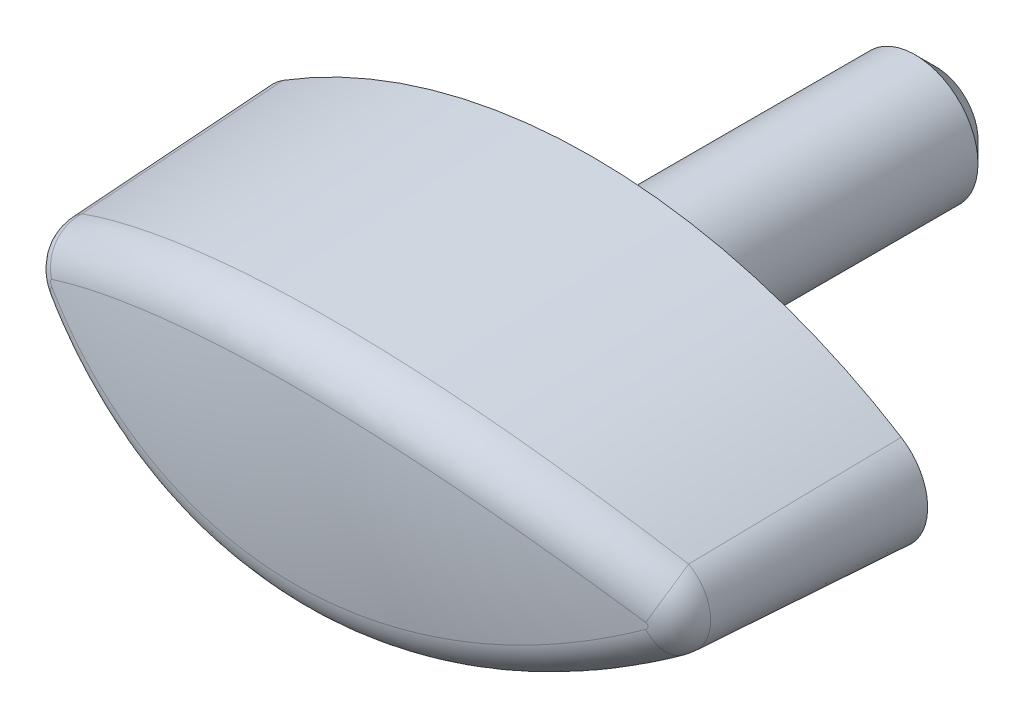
ISO-10303-21;
HEADER;
FILE_DESCRIPTION(('STEP AP214'),'2;1');
FILE_NAME('part.step','',(''),(''),'','','');
FILE_SCHEMA(('AUTOMOTIVE_DESIGN { 1 0 10303 214 1 1 1 1 }'));
ENDSEC;
DATA;
#1=APPLICATION_CONTEXT('core data for automotive mechanical design processes');
#2=APPLICATION_PROTOCOL_DEFINITION('international standard','automotive_design',2000,#1);
#3=PRODUCT_CONTEXT('',#1,'mechanical');
#4=PRODUCT('Part','Part','',(#3));
#5=PRODUCT_RELATED_PRODUCT_CATEGORY('part','',(#4));
#6=PRODUCT_DEFINITION_FORMATION('','',#4);
#7=PRODUCT_DEFINITION_CONTEXT('part definition',#1,'design');
#8=PRODUCT_DEFINITION('design','',#6,#7);
#9=PRODUCT_DEFINITION_SHAPE('','',#8);
#10=(LENGTH_UNIT() NAMED_UNIT(*) SI_UNIT(.MILLI.,.METRE.));
#11=(NAMED_UNIT(*) PLANE_ANGLE_UNIT() SI_UNIT($,.RADIAN.));
#12=(NAMED_UNIT(*) SI_UNIT($,.STERADIAN.) SOLID_ANGLE_UNIT());
#13=UNCERTAINTY_MEASURE_WITH_UNIT(LENGTH_MEASURE(1.E-05),#10,'distance_accuracy_value','');
#14=(GEOMETRIC_REPRESENTATION_CONTEXT(3) GLOBAL_UNCERTAINTY_ASSIGNED_CONTEXT((#13)) GLOBAL_UNIT_ASSIGNED_CONTEXT((#10,
#11,#12)) REPRESENTATION_CONTEXT('',''));
#15=CARTESIAN_POINT('',(0.,0.,0.));
#16=DIRECTION('',(0.,0.,1.));
#17=DIRECTION('',(1.,0.,0.));
#18=AXIS2_PLACEMENT_3D('',#15,#16,#17);
#19=CARTESIAN_POINT('',(0.,0.,0.));
#20=DIRECTION('',(0.,0.,1.));
#21=DIRECTION('',(1.,0.,0.));
#22=AXIS2_PLACEMENT_3D('',#19,#20,#21);
#23=PLANE('',#22);
#24=CARTESIAN_POINT('',(0.,0.,0.));
#25=DIRECTION('',(0.,0.,1.));
#26=DIRECTION('',(1.,0.,0.));
#27=AXIS2_PLACEMENT_3D('',#24,#25,#26);
#28=CIRCLE('',#27,4.);
#29=CARTESIAN_POINT('',(4.,0.,0.));
#30=VERTEX_POINT('',#29);
#31=EDGE_CURVE('E78',#30,#30,#28,.T.);
#32=ORIENTED_EDGE('',*,*,#31,.F.);
#33=EDGE_LOOP('',(#32));
#34=FACE_BOUND('',#33,.T.);
#35=CARTESIAN_POINT('',(0.,0.,0.));
#36=DIRECTION('',(0.,0.,1.));
#37=DIRECTION('',(1.,0.,0.));
#38=AXIS2_PLACEMENT_3D('',#35,#36,#37);
#39=CIRCLE('',#38,3.);
#40=CARTESIAN_POINT('',(3.,0.,0.));
#41=VERTEX_POINT('',#40);
#42=EDGE_CURVE('E242',#41,#41,#39,.F.);
#43=ORIENTED_EDGE('',*,*,#42,.F.);
#44=EDGE_LOOP('',(#43));
#45=FACE_BOUND('',#44,.T.);
#46=ADVANCED_FACE('F14',(#34,#45),#23,.F.);
#47=CARTESIAN_POINT('',(-13.3241500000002,0.,0.4));
#48=DIRECTION('',(0.,0.,-1.));
#49=DIRECTION('',(1.,0.,0.));
#50=AXIS2_PLACEMENT_3D('',#47,#48,#49);
#51=CONICAL_SURFACE('',#50,2.67585,0.05235987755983);
#52=DIRECTION('',(-0.0277995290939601,-0.0443422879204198,-0.998629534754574));
#53=VECTOR('',#52,1.);
#54=CARTESIAN_POINT('',(-14.7454934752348,-2.26714709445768,0.4));
#55=LINE('',#54,#53);
#56=CARTESIAN_POINT('',(-14.470842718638,-1.82905899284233,10.2661511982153));
#57=VERTEX_POINT('',#56);
#58=CARTESIAN_POINT('',(-14.7454934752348,-2.26714709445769,0.4));
#59=VERTEX_POINT('',#58);
#60=EDGE_CURVE('E69',#57,#59,#55,.T.);
#61=ORIENTED_EDGE('',*,*,#60,.F.);
#62=CARTESIAN_POINT('',(-14.1111522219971,-0.165958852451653,12.0353553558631));
#63=CARTESIAN_POINT('',(-14.3823216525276,-1.89767545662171,11.9165776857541));
#64=CARTESIAN_POINT('',(-13.7599471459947,-2.11317980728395,10.2878692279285));
#65=CARTESIAN_POINT('',(-14.1210125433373,-0.164146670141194,12.0313468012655));
#66=CARTESIAN_POINT('',(-14.4739846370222,-1.84166140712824,11.8795007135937));
#67=CARTESIAN_POINT('',(-13.8850154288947,-2.08766924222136,10.2840750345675));
#68=CARTESIAN_POINT('',(-14.1307383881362,-0.161437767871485,12.0273921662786));
#69=CARTESIAN_POINT('',(-14.560269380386,-1.77900246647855,11.8445972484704));
#70=CARTESIAN_POINT('',(-14.0079170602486,-2.05088202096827,10.2803318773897));
#71=CARTESIAN_POINT('',(-14.1496435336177,-0.154292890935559,12.0197038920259));
#72=CARTESIAN_POINT('',(-14.7199907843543,-1.6436778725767,11.779984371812));
#73=CARTESIAN_POINT('',(-14.2460605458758,-1.95582519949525,10.2730547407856));
#74=CARTESIAN_POINT('',(-14.15882204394,-0.149854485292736,12.015970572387));
#75=CARTESIAN_POINT('',(-14.7937592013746,-1.57105955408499,11.7501408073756));
#76=CARTESIAN_POINT('',(-14.3612913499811,-1.89752536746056,10.269521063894));
#77=CARTESIAN_POINT('',(-14.175595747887,-0.139761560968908,12.0091469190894));
#78=CARTESIAN_POINT('',(-14.9230565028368,-1.42425839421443,11.6978300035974));
#79=CARTESIAN_POINT('',(-14.5712596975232,-1.7663013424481,10.2630623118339));
#80=CARTESIAN_POINT('',(-14.183259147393,-0.134239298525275,12.0060289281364));
#81=CARTESIAN_POINT('',(-14.9797757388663,-1.35077369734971,11.6748814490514));
#82=CARTESIAN_POINT('',(-14.6669048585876,-1.69500184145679,10.2601110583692));
#83=CARTESIAN_POINT('',(-14.1976322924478,-0.121907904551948,12.0001802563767));
#84=CARTESIAN_POINT('',(-15.0827180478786,-1.19848356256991,11.633229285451));
#85=CARTESIAN_POINT('',(-14.8458739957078,-1.5367434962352,10.2545751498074));
#86=CARTESIAN_POINT('',(-14.2043429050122,-0.115099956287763,11.9974492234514));
#87=CARTESIAN_POINT('',(-15.1291674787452,-1.11960817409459,11.6144341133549));
#88=CARTESIAN_POINT('',(-14.9292091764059,-1.44979905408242,10.2519901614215));
#89=CARTESIAN_POINT('',(-14.2166059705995,-0.100314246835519,11.9924580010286));
#90=CARTESIAN_POINT('',(-15.2118238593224,-0.957298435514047,11.5809869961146));
#91=CARTESIAN_POINT('',(-15.0812034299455,-1.26176895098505,10.247265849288));
#92=CARTESIAN_POINT('',(-14.2221544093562,-0.0923325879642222,11.9901994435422));
#93=CARTESIAN_POINT('',(-15.2481840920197,-0.873720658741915,11.5662730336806));
#94=CARTESIAN_POINT('',(-15.1498116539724,-1.16063622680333,10.2451280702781));
#95=CARTESIAN_POINT('',(-14.2318417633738,-0.0754229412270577,11.9862557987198));
#96=CARTESIAN_POINT('',(-15.310410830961,-0.703304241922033,11.5410908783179));
#97=CARTESIAN_POINT('',(-15.2694263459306,-0.947014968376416,10.2413953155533));
#98=CARTESIAN_POINT('',(-14.2359807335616,-0.0664949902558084,11.9845706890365));
#99=CARTESIAN_POINT('',(-15.3364272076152,-0.616295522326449,11.5305620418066));
#100=CARTESIAN_POINT('',(-15.3204334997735,-0.834526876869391,10.2398003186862));
#101=CARTESIAN_POINT('',(-14.2424682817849,-0.0485036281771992,11.9819292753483));
#102=CARTESIAN_POINT('',(-15.3766810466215,-0.445231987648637,11.5142709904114));
#103=CARTESIAN_POINT('',(-15.4003125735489,-0.608271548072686,10.237300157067));
#104=CARTESIAN_POINT('',(-14.2449065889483,-0.0394779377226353,11.9809364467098));
#105=CARTESIAN_POINT('',(-15.3915978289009,-0.361143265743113,11.5082338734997));
#106=CARTESIAN_POINT('',(-15.4302943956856,-0.494954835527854,10.2363604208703));
#107=CARTESIAN_POINT('',(-14.2482592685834,-0.0211036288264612,11.9795712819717));
#108=CARTESIAN_POINT('',(-15.4119845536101,-0.192069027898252,11.4999829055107));
#109=CARTESIAN_POINT('',(-15.4715064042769,-0.264474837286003,10.2350682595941));
#110=CARTESIAN_POINT('',(-14.249174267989,-0.011755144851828,11.9791986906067));
#111=CARTESIAN_POINT('',(-15.4175053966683,-0.10689278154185,11.4977484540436));
#112=CARTESIAN_POINT('',(-15.4827443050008,-0.147313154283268,10.2347155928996));
#113=CARTESIAN_POINT('',(-14.2494335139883,0.00648408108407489,11.9790931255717));
#114=CARTESIAN_POINT('',(-15.4190697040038,0.058951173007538,11.4971153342));
#115=CARTESIAN_POINT('',(-15.485928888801,0.0812574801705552,10.2346156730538));
#116=CARTESIAN_POINT('',(-14.2488561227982,0.0153736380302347,11.9793282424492));
#117=CARTESIAN_POINT('',(-15.4155895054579,0.139798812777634,11.4985238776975));
#118=CARTESIAN_POINT('',(-15.4788379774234,0.192652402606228,10.2348382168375));
#119=CARTESIAN_POINT('',(-14.2463190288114,0.0329181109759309,11.9803613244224));
#120=CARTESIAN_POINT('',(-15.4002047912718,0.300526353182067,11.5047504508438));
#121=CARTESIAN_POINT('',(-15.4476586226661,0.412646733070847,10.235816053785));
#122=CARTESIAN_POINT('',(-14.2443595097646,0.0415730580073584,11.9811592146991));
#123=CARTESIAN_POINT('',(-15.3882693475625,0.380571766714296,11.509580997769));
#124=CARTESIAN_POINT('',(-15.4235724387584,0.521246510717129,10.2365712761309));
#125=CARTESIAN_POINT('',(-14.2391494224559,0.0583683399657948,11.9832805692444));
#126=CARTESIAN_POINT('',(-15.3561638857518,0.538484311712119,11.5225744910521));
#127=CARTESIAN_POINT('',(-15.3594579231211,0.732277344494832,10.238579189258));
#128=CARTESIAN_POINT('',(-14.2359051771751,0.066510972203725,11.9846014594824));
#129=CARTESIAN_POINT('',(-15.3359693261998,0.616511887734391,11.5307473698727));
#130=CARTESIAN_POINT('',(-15.3195076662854,0.834735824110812,10.2398294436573));
#131=CARTESIAN_POINT('',(-14.2282440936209,0.0821264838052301,11.9877204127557));
#132=CARTESIAN_POINT('',(-15.2874641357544,0.770070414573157,11.5503771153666));
#133=CARTESIAN_POINT('',(-15.2250224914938,1.0316320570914,10.2427816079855));
#134=CARTESIAN_POINT('',(-14.2238268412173,0.0895991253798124,11.9895186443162));
#135=CARTESIAN_POINT('',(-15.2590568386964,0.845729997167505,11.5618730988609));
#136=CARTESIAN_POINT('',(-15.1704824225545,1.12606696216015,10.2444836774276));
#137=CARTESIAN_POINT('',(-14.2137612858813,0.104002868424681,11.9936158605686));
#138=CARTESIAN_POINT('',(-15.1928617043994,0.99695391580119,11.5886601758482));
#139=CARTESIAN_POINT('',(-15.0459668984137,1.30860670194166,10.2483617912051));
#140=CARTESIAN_POINT('',(-14.2080691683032,0.110898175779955,11.9959326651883));
#141=CARTESIAN_POINT('',(-15.1546094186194,1.07247135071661,11.6041391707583));
#142=CARTESIAN_POINT('',(-14.9754405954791,1.39628070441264,10.2505547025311));
#143=CARTESIAN_POINT('',(-14.1957613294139,0.123631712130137,12.0009416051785));
#144=CARTESIAN_POINT('',(-15.0694987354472,1.21914960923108,11.638578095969));
#145=CARTESIAN_POINT('',(-14.8225909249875,1.55881794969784,10.2552957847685));
#146=CARTESIAN_POINT('',(-14.1891467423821,0.129471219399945,12.0036332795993));
#147=CARTESIAN_POINT('',(-15.0224895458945,1.29040002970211,11.6575990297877));
#148=CARTESIAN_POINT('',(-14.7402820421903,1.63369667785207,10.2578435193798));
#149=CARTESIAN_POINT('',(-14.1773697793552,0.138352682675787,12.0084250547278));
#150=CARTESIAN_POINT('',(-14.9360880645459,1.40603579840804,11.6925572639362));
#151=CARTESIAN_POINT('',(-14.5933599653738,1.74816987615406,10.2623790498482));
#152=CARTESIAN_POINT('',(-14.1724000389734,0.141698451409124,12.0104469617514));
#153=CARTESIAN_POINT('',(-14.8987295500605,1.45201881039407,11.7076721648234));
#154=CARTESIAN_POINT('',(-14.5312610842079,1.79147617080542,10.2642928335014));
#155=CARTESIAN_POINT('',(-14.1585614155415,0.149986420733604,12.0160765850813));
#156=CARTESIAN_POINT('',(-14.7916892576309,1.57315694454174,11.7509782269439));
#157=CARTESIAN_POINT('',(-14.358021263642,1.8992545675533,10.2696214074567));
#158=CARTESIAN_POINT('',(-14.1494117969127,0.15439310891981,12.019798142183));
#159=CARTESIAN_POINT('',(-14.7180908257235,1.64542185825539,11.7807529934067));
#160=CARTESIAN_POINT('',(-14.2431465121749,1.95714897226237,10.2731439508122));
#161=CARTESIAN_POINT('',(-14.1304899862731,0.161518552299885,12.0274931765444));
#162=CARTESIAN_POINT('',(-14.5581071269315,1.7806938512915,11.8454719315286));
#163=CARTESIAN_POINT('',(-14.0047825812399,2.05196680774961,10.2804274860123));
#164=CARTESIAN_POINT('',(-14.120713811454,0.164225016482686,12.0314682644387));
#165=CARTESIAN_POINT('',(-14.4712934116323,1.84355858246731,11.8805893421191));
#166=CARTESIAN_POINT('',(-13.8812376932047,2.08873737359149,10.2841900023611));
#167=CARTESIAN_POINT('',(-14.1108098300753,0.16602164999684,12.0354945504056));
#168=CARTESIAN_POINT('',(-14.3791069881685,1.8996354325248,11.9178779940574));
#169=CARTESIAN_POINT('',(-13.7556046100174,2.11406366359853,10.2880009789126));
#170=(BOUNDED_SURFACE() B_SPLINE_SURFACE(3,2,((#62,#63,#64),(#65,#66,#67),(#68,#69,#70),(#71,
#72,#73),(#74,#75,#76),(#77,#78,#79),(#80,#81,#82),(#83,#84,#85),(#86,#87,#88),(#89,#90,#91),
(#92,#93,#94),(#95,#96,#97),(#98,#99,#100),(#101,#102,#103),(#104,#105,#106),(#107,#108,#109),
(#110,#111,#112),(#113,#114,#115),(#116,#117,#118),(#119,#120,#121),(#122,#123,#124),(#125,#126,
#127),(#128,#129,#130),(#131,#132,#133),(#134,#135,#136),(#137,#138,#139),(#140,#141,#142),
(#143,#144,#145),(#146,#147,#148),(#149,#150,#151),(#152,#153,#154),(#155,#156,#157),(#158,#159,
#160),(#161,#162,#163),(#164,#165,#166),(#167,#168,#169)),.UNSPECIFIED.,.F.,.F.,
.F.) B_SPLINE_SURFACE_WITH_KNOTS((4,2,2,2,2,2,2,2,2,2,2,2,2,2,2,2,2,4),(3,3),(0.,
0.0306369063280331,0.0613170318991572,0.0894390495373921,0.117535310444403,0.145727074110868,
0.173917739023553,0.200477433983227,0.227026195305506,0.252209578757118,0.277389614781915,
0.30244723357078,0.327513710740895,0.353630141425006,0.379714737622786,0.397643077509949,
0.428199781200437,0.458974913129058),(0.,1.),
.UNSPECIFIED.) GEOMETRIC_REPRESENTATION_ITEM() RATIONAL_B_SPLINE_SURFACE(((1.,0.75130211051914,
1.),(1.,0.758551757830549,1.),(1.,0.765564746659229,1.),(1.,0.77898188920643,1.),(1.,
0.78538517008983,1.),(1.,0.796924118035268,1.),(1.,0.80212096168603,1.),(1.,0.811762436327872,
1.),(1.,0.816207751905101,1.),(1.,0.824260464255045,1.),(1.,0.827864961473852,1.),(1.,
0.834118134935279,1.),(1.,0.836766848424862,1.),(1.,0.840902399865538,1.),(1.,0.842447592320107,
1.),(1.,0.844569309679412,1.),(1.,0.84514623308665,1.),(1.,0.845309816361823,1.),(1.,
0.844945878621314,1.),(1.,0.843341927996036,1.),(1.,0.842102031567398,1.),(1.,0.838788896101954,
1.),(1.,0.836719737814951,1.),(1.,0.831800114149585,1.),(1.,0.828949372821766,1.),(1.,
0.822397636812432,1.),(1.,0.818666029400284,1.),(1.,0.810510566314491,1.),(1.,0.806087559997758,
1.),(1.,0.79811623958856,1.),(1.,0.794726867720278,1.),(1.,0.785203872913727,1.),(1.,
0.778818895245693,1.),(1.,0.765386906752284,1.),(1.,0.758335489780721,1.),(1.,0.751050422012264,1.))) REPRESENTATION_ITEM('') SURFACE());
#171=CARTESIAN_POINT('',(-13.7599471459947,-2.11317980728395,10.2878692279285));
#172=CARTESIAN_POINT('',(-13.8850154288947,-2.08766924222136,10.2840750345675));
#173=CARTESIAN_POINT('',(-14.0079170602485,-2.05088202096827,10.2803318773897));
#174=CARTESIAN_POINT('',(-14.2460605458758,-1.95582519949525,10.2730547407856));
#175=CARTESIAN_POINT('',(-14.3612913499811,-1.89752536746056,10.269521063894));
#176=CARTESIAN_POINT('',(-14.5712596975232,-1.7663013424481,10.2630623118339));
#177=CARTESIAN_POINT('',(-14.6669048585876,-1.69500184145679,10.2601110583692));
#178=CARTESIAN_POINT('',(-14.8458739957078,-1.5367434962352,10.2545751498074));
#179=CARTESIAN_POINT('',(-14.9292091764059,-1.44979905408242,10.2519901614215));
#180=CARTESIAN_POINT('',(-15.0812034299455,-1.26176895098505,10.247265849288));
#181=CARTESIAN_POINT('',(-15.1498116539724,-1.16063622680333,10.2451280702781));
#182=CARTESIAN_POINT('',(-15.2694263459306,-0.947014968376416,10.2413953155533));
#183=CARTESIAN_POINT('',(-15.3204334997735,-0.834526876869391,10.2398003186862));
#184=CARTESIAN_POINT('',(-15.4003125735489,-0.608271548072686,10.237300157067));
#185=CARTESIAN_POINT('',(-15.4302943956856,-0.494954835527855,10.2363604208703));
#186=CARTESIAN_POINT('',(-15.4715064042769,-0.264474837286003,10.2350682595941));
#187=CARTESIAN_POINT('',(-15.4827443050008,-0.147313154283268,10.2347155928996));
#188=CARTESIAN_POINT('',(-15.485928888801,0.0812574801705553,10.2346156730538));
#189=CARTESIAN_POINT('',(-15.4788379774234,0.192652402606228,10.2348382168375));
#190=CARTESIAN_POINT('',(-15.4476586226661,0.412646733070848,10.235816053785));
#191=CARTESIAN_POINT('',(-15.4235724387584,0.521246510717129,10.2365712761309));
#192=CARTESIAN_POINT('',(-15.3594579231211,0.732277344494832,10.238579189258));
#193=CARTESIAN_POINT('',(-15.3195076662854,0.834735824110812,10.2398294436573));
#194=CARTESIAN_POINT('',(-15.2250224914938,1.0316320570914,10.2427816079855));
#195=CARTESIAN_POINT('',(-15.1704824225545,1.12606696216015,10.2444836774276));
#196=CARTESIAN_POINT('',(-15.0459668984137,1.30860670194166,10.2483617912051));
#197=CARTESIAN_POINT('',(-14.9754405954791,1.39628070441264,10.2505547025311));
#198=CARTESIAN_POINT('',(-14.8225909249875,1.55881794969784,10.2552957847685));
#199=CARTESIAN_POINT('',(-14.7402820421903,1.63369667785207,10.2578435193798));
#200=CARTESIAN_POINT('',(-14.5933599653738,1.74816987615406,10.2623790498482));
#201=CARTESIAN_POINT('',(-14.5312610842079,1.79147617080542,10.2642928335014));
#202=CARTESIAN_POINT('',(-14.358021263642,1.8992545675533,10.2696214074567));
#203=CARTESIAN_POINT('',(-14.2431465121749,1.95714897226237,10.2731439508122));
#204=CARTESIAN_POINT('',(-14.0047825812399,2.05196680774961,10.2804274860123));
#205=CARTESIAN_POINT('',(-13.8812376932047,2.08873737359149,10.2841900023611));
#206=CARTESIAN_POINT('',(-13.7556046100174,2.11406366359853,10.2880009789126));
#207=B_SPLINE_CURVE_WITH_KNOTS('',3,(#171,#172,#173,#174,#175,#176,#177,#178,#179,#180,#181,
#182,#183,#184,#185,#186,#187,#188,#189,#190,#191,#192,#193,#194,#195,#196,#197,#198,#199,#200,
#201,#202,#203,#204,#205,#206),.UNSPECIFIED.,.F.,.F.,(4,2,2,2,2,2,2,2,2,2,2,2,2,2,2,2,2,4),(0.,
0.0306369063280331,0.0613170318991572,0.0894390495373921,0.117535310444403,0.145727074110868,
0.173917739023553,0.200477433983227,0.227026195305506,0.252209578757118,0.277389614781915,
0.30244723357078,0.327513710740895,0.353630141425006,0.379714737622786,0.397643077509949,
0.428199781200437,0.458974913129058),.UNSPECIFIED.);
#208=CARTESIAN_POINT('',(-14.4672021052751,1.83132944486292,10.266263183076));
#209=VERTEX_POINT('',#208);
#210=EDGE_CURVE('E38',#57,#209,#207,.T.);
#211=ORIENTED_EDGE('',*,*,#210,.T.);
#212=DIRECTION('',(-0.0277113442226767,0.044397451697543,-0.998629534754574));
#213=VECTOR('',#212,1.);
#214=CARTESIAN_POINT('',(-14.740984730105,2.2699675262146,0.4));
#215=LINE('',#214,#213);
#216=CARTESIAN_POINT('',(-14.740984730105,2.26996752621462,0.4));
#217=VERTEX_POINT('',#216);
#218=EDGE_CURVE('E91',#209,#217,#215,.T.);
#219=ORIENTED_EDGE('',*,*,#218,.T.);
#220=CARTESIAN_POINT('',(-13.3241500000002,0.,0.4));
#221=DIRECTION('',(0.,0.,1.));
#222=DIRECTION('',(1.,0.,0.));
#223=AXIS2_PLACEMENT_3D('',#220,#221,#222);
#224=CIRCLE('',#223,2.67585);
#225=EDGE_CURVE('E86',#217,#59,#224,.T.);
#226=ORIENTED_EDGE('',*,*,#225,.T.);
#227=EDGE_LOOP('',(#61,#211,#219,#226));
#228=FACE_BOUND('',#227,.T.);
#229=ADVANCED_FACE('F90',(#228),#51,.T.);
#230=CARTESIAN_POINT('',(0.,21.2529965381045,0.4));
#231=DIRECTION('',(0.,0.,-1.));
#232=DIRECTION('',(1.,0.,0.));
#233=AXIS2_PLACEMENT_3D('',#230,#231,#232);
#234=CONICAL_SURFACE('',#233,27.7601645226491,0.05235987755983);
#235=DIRECTION('',(0.0277995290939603,-0.0443422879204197,-0.998629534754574));
#236=VECTOR('',#235,1.);
#237=CARTESIAN_POINT('',(14.7454934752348,-2.2671470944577,0.4));
#238=LINE('',#237,#236);
#239=CARTESIAN_POINT('',(14.4708427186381,-1.82905899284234,10.2661511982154));
#240=VERTEX_POINT('',#239);
#241=CARTESIAN_POINT('',(14.7454934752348,-2.2671470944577,0.4));
#242=VERTEX_POINT('',#241);
#243=EDGE_CURVE('E79',#240,#242,#238,.T.);
#244=ORIENTED_EDGE('',*,*,#243,.F.);
#245=CARTESIAN_POINT('',(20.9050060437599,5.54532875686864,7.9121295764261));
#246=CARTESIAN_POINT('',(21.7174475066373,4.55531908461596,7.53542153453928));
#247=CARTESIAN_POINT('',(21.3399844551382,3.99277493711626,6.38513680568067));
#248=CARTESIAN_POINT('',(20.6760760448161,5.27938420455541,8.11731061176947));
#249=CARTESIAN_POINT('',(21.4880466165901,4.27500771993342,7.74353533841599));
#250=CARTESIAN_POINT('',(21.1069121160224,3.72079448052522,6.57934559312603));
#251=CARTESIAN_POINT('',(20.4406185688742,5.01594720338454,8.31838499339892));
#252=CARTESIAN_POINT('',(21.2520919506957,3.99758864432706,7.94725170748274));
#253=CARTESIAN_POINT('',(20.8671443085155,3.45135943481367,6.76966733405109));
#254=CARTESIAN_POINT('',(19.9566154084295,4.49488377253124,8.71221504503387));
#255=CARTESIAN_POINT('',(20.7660305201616,3.44806434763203,8.34676773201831));
#256=CARTESIAN_POINT('',(20.3741824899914,2.9183968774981,7.14243695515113));
#257=CARTESIAN_POINT('',(19.7080684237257,4.23725792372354,8.90496988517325));
#258=CARTESIAN_POINT('',(20.515875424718,3.17600018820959,8.54251933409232));
#259=CARTESIAN_POINT('',(20.1209871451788,2.6548699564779,7.32488404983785));
#260=CARTESIAN_POINT('',(18.94245673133,3.47401354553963,9.47080065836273));
#261=CARTESIAN_POINT('',(19.7420383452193,2.3670337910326,9.11914619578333));
#262=CARTESIAN_POINT('',(19.3409148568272,1.87409331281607,7.86045649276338));
#263=CARTESIAN_POINT('',(18.4057415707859,2.97840260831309,9.83115538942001));
#264=CARTESIAN_POINT('',(19.198409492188,1.84154871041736,9.48630048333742));
#265=CARTESIAN_POINT('',(18.7938777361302,1.36703064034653,8.20154091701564));
#266=CARTESIAN_POINT('',(17.2801500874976,2.02006402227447,10.5170899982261));
#267=CARTESIAN_POINT('',(18.0538112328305,0.822138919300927,10.187243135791));
#268=CARTESIAN_POINT('',(17.6462833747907,0.38643701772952,8.85079453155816));
#269=CARTESIAN_POINT('',(16.6911440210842,1.55742360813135,10.8425786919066));
#270=CARTESIAN_POINT('',(17.4525055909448,0.328829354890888,10.5204794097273));
#271=CARTESIAN_POINT('',(17.0455929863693,-0.0870049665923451,9.15887741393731));
#272=CARTESIAN_POINT('',(15.4647399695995,0.673629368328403,11.4560252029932));
#273=CARTESIAN_POINT('',(16.1957186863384,-0.616703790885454,11.150442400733));
#274=CARTESIAN_POINT('',(15.7945383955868,-0.991524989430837,9.73951929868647));
#275=CARTESIAN_POINT('',(14.8273638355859,0.252457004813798,11.7439998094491));
#276=CARTESIAN_POINT('',(15.5402190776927,-1.06832180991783,11.4466965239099));
#277=CARTESIAN_POINT('',(15.1441966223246,-1.42262195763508,10.0120941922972));
#278=CARTESIAN_POINT('',(13.6144082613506,-0.477469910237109,12.2374446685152));
#279=CARTESIAN_POINT('',(14.2889658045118,-1.85317589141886,11.95558717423));
#280=CARTESIAN_POINT('',(13.9063053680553,-2.16981425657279,10.4791516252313));
#281=CARTESIAN_POINT('',(13.0454878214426,-0.793392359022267,12.4487272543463));
#282=CARTESIAN_POINT('',(13.7001600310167,-2.19368449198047,12.1739252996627));
#283=CARTESIAN_POINT('',(13.325592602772,-2.49323585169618,10.6791356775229));
#284=CARTESIAN_POINT('',(11.8788560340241,-1.38752516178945,12.8428373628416));
#285=CARTESIAN_POINT('',(12.4893007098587,-2.83576538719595,12.5821905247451));
#286=CARTESIAN_POINT('',(12.1346036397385,-3.10151067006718,11.0521703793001));
#287=CARTESIAN_POINT('',(11.281148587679,-1.66574060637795,13.0256687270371));
#288=CARTESIAN_POINT('',(11.8674609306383,-3.13691358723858,12.771827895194));
#289=CARTESIAN_POINT('',(11.5243314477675,-3.38636909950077,11.2252246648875));
#290=CARTESIAN_POINT('',(10.0612672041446,-2.18050261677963,13.3616744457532));
#291=CARTESIAN_POINT('',(10.5949943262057,-3.6955197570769,13.1211546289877));
#292=CARTESIAN_POINT('',(10.2786549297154,-3.91345047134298,11.5432621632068));
#293=CARTESIAN_POINT('',(9.43913707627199,-2.41711996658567,13.5148992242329));
#294=CARTESIAN_POINT('',(9.94474128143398,-3.95263187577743,13.2806192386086));
#295=CARTESIAN_POINT('',(9.64329559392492,-4.15574583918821,11.6882931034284));
#296=CARTESIAN_POINT('',(8.17328674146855,-2.84614618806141,13.7912422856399));
#297=CARTESIAN_POINT('',(8.61856304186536,-4.41991057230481,13.5688401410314));
#298=CARTESIAN_POINT('',(8.3504024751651,-4.59508619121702,11.9498584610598));
#299=CARTESIAN_POINT('',(7.52956656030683,-3.03855511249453,13.9143606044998));
#300=CARTESIAN_POINT('',(7.94308247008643,-4.62968572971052,13.6973476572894));
#301=CARTESIAN_POINT('',(7.69286871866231,-4.79213122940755,12.0663929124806));
#302=CARTESIAN_POINT('',(6.22276774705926,-3.37707024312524,14.1301139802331));
#303=CARTESIAN_POINT('',(6.56904081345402,-4.99952533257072,13.9229853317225));
#304=CARTESIAN_POINT('',(6.35792888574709,-5.13881412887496,12.2706086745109));
#305=CARTESIAN_POINT('',(5.55963336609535,-3.52302508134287,14.222649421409));
#306=CARTESIAN_POINT('',(5.87097647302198,-5.15908700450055,14.0198018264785));
#307=CARTESIAN_POINT('',(5.68046554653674,-5.28829701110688,12.3581956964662));
#308=CARTESIAN_POINT('',(4.22079235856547,-3.76571142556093,14.376114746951));
#309=CARTESIAN_POINT('',(4.4593178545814,-5.4248682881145,14.1806368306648));
#310=CARTESIAN_POINT('',(4.31262439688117,-5.53685491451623,12.5034543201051));
#311=CARTESIAN_POINT('',(3.54508559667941,-3.86244240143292,14.4370442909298));
#312=CARTESIAN_POINT('',(3.74637181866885,-5.53082904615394,14.2444974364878));
#313=CARTESIAN_POINT('',(3.6222464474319,-5.63592939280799,12.561125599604));
#314=CARTESIAN_POINT('',(2.18579315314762,-4.00532107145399,14.5269316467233));
#315=CARTESIAN_POINT('',(2.31046020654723,-5.68755977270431,14.3388364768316));
#316=CARTESIAN_POINT('',(2.23339915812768,-5.7822710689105,12.6462061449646));
#317=CARTESIAN_POINT('',(1.50220274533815,-4.05143663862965,14.5558691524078));
#318=CARTESIAN_POINT('',(1.58820308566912,-5.7381359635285,14.369197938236));
#319=CARTESIAN_POINT('',(1.53492496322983,-5.82950536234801,12.6735961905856));
#320=CARTESIAN_POINT('',(0.132902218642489,-4.09229415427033,14.5815109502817));
#321=CARTESIAN_POINT('',(0.140416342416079,-5.78299001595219,14.396128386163));
#322=CARTESIAN_POINT('',(0.135798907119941,-5.87135399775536,12.6978667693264));
#323=CARTESIAN_POINT('',(-0.552807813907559,-4.08703816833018,14.5782165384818));
#324=CARTESIAN_POINT('',(-0.584367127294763,-5.77722387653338,14.3926709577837));
#325=CARTESIAN_POINT('',(-0.56485286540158,-5.8659704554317,12.6947485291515));
#326=CARTESIAN_POINT('',(-1.89394621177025,-4.02646090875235,14.5401880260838));
#327=CARTESIAN_POINT('',(-2.00224881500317,-5.71072593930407,14.3527337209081));
#328=CARTESIAN_POINT('',(-1.93519747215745,-5.80392386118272,12.6587536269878));
#329=CARTESIAN_POINT('',(-2.54950092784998,-3.97312519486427,14.5067007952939));
#330=CARTESIAN_POINT('',(-2.69477989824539,-5.65223744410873,14.3176016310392));
#331=CARTESIAN_POINT('',(-2.60502009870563,-5.74929452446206,12.6270571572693));
#332=CARTESIAN_POINT('',(-3.85294450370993,-3.8198674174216,14.4102200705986));
#333=CARTESIAN_POINT('',(-4.07135869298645,-5.48415724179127,14.2163617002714));
#334=CARTESIAN_POINT('',(-3.93679047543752,-5.59232303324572,12.5357358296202));
#335=CARTESIAN_POINT('',(-4.50083331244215,-3.71994504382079,14.3472263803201));
#336=CARTESIAN_POINT('',(-4.75478134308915,-5.37472133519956,14.150347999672));
#337=CARTESIAN_POINT('',(-4.59873817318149,-5.48998056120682,12.4761107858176));
#338=CARTESIAN_POINT('',(-5.7838363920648,-3.47495260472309,14.1921729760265));
#339=CARTESIAN_POINT('',(-6.10715893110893,-5.10648464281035,13.9878860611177));
#340=CARTESIAN_POINT('',(-5.90951464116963,-5.23906249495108,12.3293490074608));
#341=CARTESIAN_POINT('',(-6.41896223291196,-3.32992559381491,14.1001409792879));
#342=CARTESIAN_POINT('',(-6.77556008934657,-4.94797002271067,13.8916129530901));
#343=CARTESIAN_POINT('',(-6.55835529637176,-5.09053099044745,12.2422385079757));
#344=CARTESIAN_POINT('',(-7.67269500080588,-2.99665755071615,13.887559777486));
#345=CARTESIAN_POINT('',(-8.09342362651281,-4.58395230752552,13.6693403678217));
#346=CARTESIAN_POINT('',(-7.83907014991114,-4.74922402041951,12.0410252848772));
#347=CARTESIAN_POINT('',(-8.29130409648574,-2.80842222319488,13.7670143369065));
#348=CARTESIAN_POINT('',(-8.74240334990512,-4.37876017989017,13.5435342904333));
#349=CARTESIAN_POINT('',(-8.47094657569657,-4.55645439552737,11.9269261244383));
#350=CARTESIAN_POINT('',(-9.83278621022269,-2.27973915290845,13.426286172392));
#351=CARTESIAN_POINT('',(-10.3553075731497,-3.80366082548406,13.1886003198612));
#352=CARTESIAN_POINT('',(-10.0453448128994,-4.015063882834,11.6044187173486));
#353=CARTESIAN_POINT('',(-10.7421972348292,-1.91162341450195,13.187233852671));
#354=CARTESIAN_POINT('',(-11.3043510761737,-3.40434408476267,12.9402193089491));
#355=CARTESIAN_POINT('',(-10.9740391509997,-3.63812328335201,11.3781499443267));
#356=CARTESIAN_POINT('',(-12.5017898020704,-1.08947558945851,12.6462122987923));
#357=CARTESIAN_POINT('',(-13.1351357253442,-2.51404099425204,12.3787755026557));
#358=CARTESIAN_POINT('',(-12.7706034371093,-2.79635357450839,10.8660600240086));
#359=CARTESIAN_POINT('',(-13.3519400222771,-0.635398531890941,12.3442101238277));
#360=CARTESIAN_POINT('',(-14.0159911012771,-2.02438542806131,12.0666016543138));
#361=CARTESIAN_POINT('',(-13.6384412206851,-2.33147846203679,10.5802076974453));
#362=CARTESIAN_POINT('',(-14.826173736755,0.251726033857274,11.7444918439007));
#363=CARTESIAN_POINT('',(-15.5389898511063,-1.06910489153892,11.4472009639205));
#364=CARTESIAN_POINT('',(-15.1429821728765,-1.42337021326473,10.0125599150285));
#365=CARTESIAN_POINT('',(-15.4622686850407,0.671990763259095,11.4571450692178));
#366=CARTESIAN_POINT('',(-16.1931839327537,-0.618454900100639,11.151590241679));
#367=CARTESIAN_POINT('',(-15.7920168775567,-0.993202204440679,9.74057927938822));
#368=CARTESIAN_POINT('',(-16.6865483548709,1.55397020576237,10.8449931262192));
#369=CARTESIAN_POINT('',(-17.4478169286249,0.325148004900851,10.5229507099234));
#370=CARTESIAN_POINT('',(-17.0409055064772,-0.0905391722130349,9.16116273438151));
#371=CARTESIAN_POINT('',(-17.2746998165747,2.01571323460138,10.5201623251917));
#372=CARTESIAN_POINT('',(-18.0482607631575,0.817508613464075,10.1903830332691));
#373=CARTESIAN_POINT('',(-17.640725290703,0.381984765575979,8.85370256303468));
#374=CARTESIAN_POINT('',(-18.4008102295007,2.97391732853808,9.83440708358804));
#375=CARTESIAN_POINT('',(-19.193401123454,1.83678082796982,9.48962193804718));
#376=CARTESIAN_POINT('',(-18.7888512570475,1.36244162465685,8.20461872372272));
#377=CARTESIAN_POINT('',(-18.9387119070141,3.47041690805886,9.47344240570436));
#378=CARTESIAN_POINT('',(-19.7382446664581,2.36321569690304,9.12184197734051));
#379=CARTESIAN_POINT('',(-19.3370986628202,1.87041382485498,7.86295697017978));
#380=CARTESIAN_POINT('',(-19.7058984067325,4.23502684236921,8.90663609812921));
#381=CARTESIAN_POINT('',(-20.5136886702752,3.17364131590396,8.54421339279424));
#382=CARTESIAN_POINT('',(-20.1187764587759,2.65258774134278,7.32646116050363));
#383=CARTESIAN_POINT('',(-19.954910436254,4.49308322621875,8.71356907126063));
#384=CARTESIAN_POINT('',(-20.7643146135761,3.44616207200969,8.34814360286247));
#385=CARTESIAN_POINT('',(-20.3724457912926,2.91655515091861,7.14371857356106));
#386=CARTESIAN_POINT('',(-20.439799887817,5.0150310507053,8.31908426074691));
#387=CARTESIAN_POINT('',(-21.2512696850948,3.99662171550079,7.94796173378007));
#388=CARTESIAN_POINT('',(-20.8663106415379,3.4504224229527,6.77032920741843));
#389=CARTESIAN_POINT('',(-20.6756785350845,5.27892194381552,8.11766725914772));
#390=CARTESIAN_POINT('',(-21.4876473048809,4.27451935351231,7.74389790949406));
#391=CARTESIAN_POINT('',(-21.1065074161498,3.72032172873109,6.57968316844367));
#392=CARTESIAN_POINT('',(-20.9050060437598,5.54532875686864,7.91212957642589));
#393=CARTESIAN_POINT('',(-21.7174475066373,4.55531908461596,7.53542153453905));
#394=CARTESIAN_POINT('',(-21.3399844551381,3.99277493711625,6.38513680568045));
#395=(BOUNDED_SURFACE() B_SPLINE_SURFACE(3,2,((#245,#246,#247),(#248,#249,#250),(#251,#252,
#253),(#254,#255,#256),(#257,#258,#259),(#260,#261,#262),(#263,#264,#265),(#266,#267,#268),
(#269,#270,#271),(#272,#273,#274),(#275,#276,#277),(#278,#279,#280),(#281,#282,#283),(#284,#285,
#286),(#287,#288,#289),(#290,#291,#292),(#293,#294,#295),(#296,#297,#298),(#299,#300,#301),
(#302,#303,#304),(#305,#306,#307),(#308,#309,#310),(#311,#312,#313),(#314,#315,#316),(#317,#318,
#319),(#320,#321,#322),(#323,#324,#325),(#326,#327,#328),(#329,#330,#331),(#332,#333,#334),
(#335,#336,#337),(#338,#339,#340),(#341,#342,#343),(#344,#345,#346),(#347,#348,#349),(#350,#351,
#352),(#353,#354,#355),(#356,#357,#358),(#359,#360,#361),(#362,#363,#364),(#365,#366,#367),
(#368,#369,#370),(#371,#372,#373),(#374,#375,#376),(#377,#378,#379),(#380,#381,#382),(#383,#384,
#385),(#386,#387,#388),(#389,#390,#391),(#392,#393,#394)),.UNSPECIFIED.,.F.,.F.,
.F.) B_SPLINE_SURFACE_WITH_KNOTS((4,2,2,2,2,2,2,2,2,2,2,2,2,2,2,2,2,2,2,2,2,2,2,2,4),(3,3),(0.,
1.15410504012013,2.30832493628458,4.61837958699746,6.93433528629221,9.2492509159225,
11.1900673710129,13.1306215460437,15.0678409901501,17.005058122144,18.948524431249,
20.8920116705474,22.8367317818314,24.7813736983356,26.649210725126,28.5170601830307,
30.3831321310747,32.2489578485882,35.1087148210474,37.969972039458,40.2803521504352,
42.5923216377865,44.9068949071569,46.0631146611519,47.2192263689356),(0.,1.),
.UNSPECIFIED.) GEOMETRIC_REPRESENTATION_ITEM() RATIONAL_B_SPLINE_SURFACE(((1.,0.831740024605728,
1.),(1.,0.829912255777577,1.),(1.,0.828093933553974,1.),(1.,0.824482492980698,1.),(1.,
0.822689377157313,1.),(1.,0.817355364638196,1.),(1.,0.813862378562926,1.),(1.,0.807056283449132,
1.),(1.,0.803743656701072,1.),(1.,0.797370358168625,1.),(1.,0.794309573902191,1.),(1.,
0.788970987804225,1.),(1.,0.786646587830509,1.),(1.,0.782254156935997,1.),(1.,0.780186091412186,
1.),(1.,0.776343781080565,1.),(1.,0.774569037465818,1.),(1.,0.771340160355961,1.),(1.,
0.769886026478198,1.),(1.,0.767321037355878,1.),(1.,0.766211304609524,1.),(1.,0.764362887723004,
1.),(1.,0.763624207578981,1.),(1.,0.762532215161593,1.),(1.,0.762179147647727,1.),(1.,
0.761866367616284,1.),(1.,0.761906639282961,1.),(1.,0.762370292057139,1.),(1.,0.762778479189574,
1.),(1.,0.763949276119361,1.),(1.,0.764711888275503,1.),(1.,0.766576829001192,1.),(1.,
0.767678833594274,1.),(1.,0.77020274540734,1.),(1.,0.771624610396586,1.),(1.,0.775602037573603,
1.),(1.,0.778358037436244,1.),(1.,0.784464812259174,1.),(1.,0.787815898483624,1.),(1.,
0.794304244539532,1.),(1.,0.797358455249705,1.),(1.,0.803718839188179,1.),(1.,0.80702518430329,
1.),(1.,0.813830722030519,1.),(1.,0.81733012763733,1.),(1.,0.822673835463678,1.),(1.,
0.824469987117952,1.),(1.,0.828087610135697,1.),(1.,0.829909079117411,1.),(1.,0.83174002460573,1.))) REPRESENTATION_ITEM('') SURFACE());
#396=CARTESIAN_POINT('',(21.3399844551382,3.99277493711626,6.38513680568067));
#397=CARTESIAN_POINT('',(21.1069121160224,3.72079448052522,6.57934559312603));
#398=CARTESIAN_POINT('',(20.8671443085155,3.45135943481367,6.76966733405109));
#399=CARTESIAN_POINT('',(20.3741824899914,2.9183968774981,7.14243695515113));
#400=CARTESIAN_POINT('',(20.1209871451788,2.6548699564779,7.32488404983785));
#401=CARTESIAN_POINT('',(19.3409148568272,1.87409331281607,7.86045649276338));
#402=CARTESIAN_POINT('',(18.7938777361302,1.36703064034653,8.20154091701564));
#403=CARTESIAN_POINT('',(17.6462833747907,0.38643701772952,8.85079453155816));
#404=CARTESIAN_POINT('',(17.0455929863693,-0.0870049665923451,9.15887741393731));
#405=CARTESIAN_POINT('',(15.7945383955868,-0.991524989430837,9.73951929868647));
#406=CARTESIAN_POINT('',(15.1441966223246,-1.42262195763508,10.0120941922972));
#407=CARTESIAN_POINT('',(13.9063053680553,-2.16981425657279,10.4791516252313));
#408=CARTESIAN_POINT('',(13.325592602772,-2.49323585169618,10.6791356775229));
#409=CARTESIAN_POINT('',(12.1346036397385,-3.10151067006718,11.0521703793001));
#410=CARTESIAN_POINT('',(11.5243314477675,-3.38636909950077,11.2252246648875));
#411=CARTESIAN_POINT('',(10.2786549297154,-3.91345047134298,11.5432621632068));
#412=CARTESIAN_POINT('',(9.64329559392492,-4.15574583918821,11.6882931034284));
#413=CARTESIAN_POINT('',(8.3504024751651,-4.59508619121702,11.9498584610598));
#414=CARTESIAN_POINT('',(7.69286871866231,-4.79213122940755,12.0663929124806));
#415=CARTESIAN_POINT('',(6.35792888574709,-5.13881412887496,12.2706086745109));
#416=CARTESIAN_POINT('',(5.68046554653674,-5.28829701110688,12.3581956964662));
#417=CARTESIAN_POINT('',(4.31262439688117,-5.53685491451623,12.5034543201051));
#418=CARTESIAN_POINT('',(3.6222464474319,-5.63592939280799,12.561125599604));
#419=CARTESIAN_POINT('',(2.23339915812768,-5.7822710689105,12.6462061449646));
#420=CARTESIAN_POINT('',(1.53492496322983,-5.82950536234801,12.6735961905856));
#421=CARTESIAN_POINT('',(0.135798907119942,-5.87135399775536,12.6978667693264));
#422=CARTESIAN_POINT('',(-0.56485286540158,-5.8659704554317,12.6947485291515));
#423=CARTESIAN_POINT('',(-1.93519747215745,-5.80392386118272,12.6587536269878));
#424=CARTESIAN_POINT('',(-2.60502009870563,-5.74929452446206,12.6270571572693));
#425=CARTESIAN_POINT('',(-3.93679047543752,-5.59232303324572,12.5357358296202));
#426=CARTESIAN_POINT('',(-4.59873817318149,-5.48998056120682,12.4761107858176));
#427=CARTESIAN_POINT('',(-5.90951464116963,-5.23906249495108,12.3293490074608));
#428=CARTESIAN_POINT('',(-6.55835529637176,-5.09053099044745,12.2422385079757));
#429=CARTESIAN_POINT('',(-7.83907014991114,-4.74922402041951,12.0410252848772));
#430=CARTESIAN_POINT('',(-8.47094657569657,-4.55645439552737,11.9269261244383));
#431=CARTESIAN_POINT('',(-10.0453448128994,-4.015063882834,11.6044187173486));
#432=CARTESIAN_POINT('',(-10.9740391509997,-3.63812328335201,11.3781499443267));
#433=CARTESIAN_POINT('',(-12.7706034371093,-2.79635357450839,10.8660600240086));
#434=CARTESIAN_POINT('',(-13.6384412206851,-2.33147846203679,10.5802076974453));
#435=CARTESIAN_POINT('',(-15.1429821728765,-1.42337021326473,10.0125599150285));
#436=CARTESIAN_POINT('',(-15.7920168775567,-0.993202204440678,9.74057927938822));
#437=CARTESIAN_POINT('',(-17.0409055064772,-0.0905391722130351,9.16116273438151));
#438=CARTESIAN_POINT('',(-17.640725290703,0.381984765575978,8.85370256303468));
#439=CARTESIAN_POINT('',(-18.7888512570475,1.36244162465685,8.20461872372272));
#440=CARTESIAN_POINT('',(-19.3370986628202,1.87041382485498,7.86295697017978));
#441=CARTESIAN_POINT('',(-20.1187764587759,2.65258774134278,7.32646116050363));
#442=CARTESIAN_POINT('',(-20.3724457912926,2.91655515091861,7.14371857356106));
#443=CARTESIAN_POINT('',(-20.8663106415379,3.4504224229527,6.77032920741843));
#444=CARTESIAN_POINT('',(-21.1065074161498,3.72032172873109,6.57968316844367));
#445=CARTESIAN_POINT('',(-21.3399844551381,3.99277493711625,6.38513680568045));
#446=B_SPLINE_CURVE_WITH_KNOTS('',3,(#396,#397,#398,#399,#400,#401,#402,#403,#404,#405,#406,
#407,#408,#409,#410,#411,#412,#413,#414,#415,#416,#417,#418,#419,#420,#421,#422,#423,#424,#425,
#426,#427,#428,#429,#430,#431,#432,#433,#434,#435,#436,#437,#438,#439,#440,#441,#442,#443,#444,
#445),.UNSPECIFIED.,.F.,.F.,(4,2,2,2,2,2,2,2,2,2,2,2,2,2,2,2,2,2,2,2,2,2,2,2,4),(0.,
1.15410504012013,2.30832493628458,4.61837958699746,6.93433528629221,9.2492509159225,
11.1900673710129,13.1306215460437,15.0678409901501,17.005058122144,18.948524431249,
20.8920116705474,22.8367317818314,24.7813736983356,26.649210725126,28.5170601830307,
30.3831321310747,32.2489578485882,35.1087148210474,37.969972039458,40.2803521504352,
42.5923216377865,44.9068949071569,46.0631146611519,47.2192263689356),.UNSPECIFIED.);
#447=EDGE_CURVE('E76',#240,#57,#446,.T.);
#448=ORIENTED_EDGE('',*,*,#447,.T.);
#449=ORIENTED_EDGE('',*,*,#60,.T.);
#450=CARTESIAN_POINT('',(0.,21.2529965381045,0.4));
#451=DIRECTION('',(0.,0.,1.));
#452=DIRECTION('',(1.,0.,0.));
#453=AXIS2_PLACEMENT_3D('',#450,#451,#452);
#454=CIRCLE('',#453,27.7601645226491);
#455=EDGE_CURVE('E73',#59,#242,#454,.T.);
#456=ORIENTED_EDGE('',*,*,#455,.T.);
#457=EDGE_LOOP('',(#244,#448,#449,#456));
#458=FACE_BOUND('',#457,.T.);
#459=ADVANCED_FACE('F72',(#458),#234,.T.);
#460=CARTESIAN_POINT('',(13.3241500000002,0.,0.4));
#461=DIRECTION('',(0.,0.,-1.));
#462=DIRECTION('',(1.,0.,0.));
#463=AXIS2_PLACEMENT_3D('',#460,#461,#462);
#464=CONICAL_SURFACE('',#463,2.67585,0.05235987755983);
#465=DIRECTION('',(0.0277113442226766,0.0443974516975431,-0.998629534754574));
#466=VECTOR('',#465,1.);
#467=CARTESIAN_POINT('',(14.740984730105,2.26996752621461,0.4));
#468=LINE('',#467,#466);
#469=CARTESIAN_POINT('',(14.4672021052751,1.83132944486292,10.2662631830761));
#470=VERTEX_POINT('',#469);
#471=CARTESIAN_POINT('',(14.740984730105,2.26996752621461,0.4));
#472=VERTEX_POINT('',#471);
#473=EDGE_CURVE('E112',#470,#472,#468,.T.);
#474=ORIENTED_EDGE('',*,*,#473,.F.);
#475=CARTESIAN_POINT('',(14.1108098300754,0.166021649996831,12.0354945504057));
#476=CARTESIAN_POINT('',(14.3791069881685,1.89963543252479,11.9178779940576));
#477=CARTESIAN_POINT('',(13.7556046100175,2.11406366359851,10.2880009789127));
#478=CARTESIAN_POINT('',(14.1206757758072,0.164229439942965,12.0314837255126));
#479=CARTESIAN_POINT('',(14.4709389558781,1.84375069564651,11.8807327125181));
#480=CARTESIAN_POINT('',(13.8807542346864,2.08880404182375,10.2842046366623));
#481=CARTESIAN_POINT('',(14.1304087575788,0.161539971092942,12.0275262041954));
#482=CARTESIAN_POINT('',(14.5573909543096,1.78120267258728,11.84576163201));
#483=CARTESIAN_POINT('',(14.0037556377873,2.05225919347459,10.2804587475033));
#484=CARTESIAN_POINT('',(14.1493311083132,0.154432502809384,12.0198309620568));
#485=CARTESIAN_POINT('',(14.7174367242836,1.64606885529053,11.7810176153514));
#486=CARTESIAN_POINT('',(14.2421335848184,1.95766601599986,10.2731750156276));
#487=CARTESIAN_POINT('',(14.1585196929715,0.150012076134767,12.0160935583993));
#488=CARTESIAN_POINT('',(14.7913628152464,1.57353154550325,11.7511102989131));
#489=CARTESIAN_POINT('',(14.3574991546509,1.89958749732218,10.2696374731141));
#490=CARTESIAN_POINT('',(14.1753172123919,0.139950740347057,12.0092602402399));
#491=CARTESIAN_POINT('',(14.9209668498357,1.42684806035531,11.6986754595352));
#492=CARTESIAN_POINT('',(14.5677797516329,1.76874922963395,10.2631695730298));
#493=CARTESIAN_POINT('',(14.182993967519,0.1344419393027,12.0061368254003));
#494=CARTESIAN_POINT('',(14.9778340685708,1.35340107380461,11.6756670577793));
#495=CARTESIAN_POINT('',(14.663597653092,1.69761255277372,10.260213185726));
#496=CARTESIAN_POINT('',(14.1973956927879,0.122134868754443,12.0002765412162));
#497=CARTESIAN_POINT('',(15.0810613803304,1.20116793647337,11.6338996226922));
#498=CARTESIAN_POINT('',(14.8429330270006,1.53964661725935,10.254666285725));
#499=CARTESIAN_POINT('',(14.20412152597,0.115337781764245,11.9975393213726));
#500=CARTESIAN_POINT('',(15.1276484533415,1.12231233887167,11.6150487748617));
#501=CARTESIAN_POINT('',(14.9264616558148,1.45283175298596,10.2520754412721));
#502=CARTESIAN_POINT('',(14.2164165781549,0.10057082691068,11.9925350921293));
#503=CARTESIAN_POINT('',(15.2105709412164,0.960026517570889,11.5814940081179));
#504=CARTESIAN_POINT('',(15.0788595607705,1.26502385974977,10.2473388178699));
#505=CARTESIAN_POINT('',(14.2219817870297,0.092597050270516,11.9902697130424));
#506=CARTESIAN_POINT('',(15.2470602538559,0.876453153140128,11.5667278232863));
#507=CARTESIAN_POINT('',(15.1476780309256,1.16398362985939,10.245194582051));
#508=CARTESIAN_POINT('',(14.2317036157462,0.0756997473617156,11.9863120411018));
#509=CARTESIAN_POINT('',(15.3095362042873,0.706031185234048,11.5414448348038));
#510=CARTESIAN_POINT('',(15.2677226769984,0.950505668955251,10.2414485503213));
#511=CARTESIAN_POINT('',(14.2358602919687,0.0667762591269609,11.9846197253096));
#512=CARTESIAN_POINT('',(15.3356733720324,0.619012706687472,11.5308671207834));
#513=CARTESIAN_POINT('',(15.318949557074,0.838068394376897,10.2398467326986));
#514=CARTESIAN_POINT('',(14.2423821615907,0.0487906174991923,11.9819643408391));
#515=CARTESIAN_POINT('',(15.3761517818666,0.447923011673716,11.5144851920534));
#516=CARTESIAN_POINT('',(15.3992531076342,0.611876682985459,10.2373333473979));
#517=CARTESIAN_POINT('',(14.2448371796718,0.0397664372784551,11.9809647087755));
#518=CARTESIAN_POINT('',(15.3911740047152,0.363819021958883,11.5084054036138));
#519=CARTESIAN_POINT('',(15.4294409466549,0.498575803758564,10.2363871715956));
#520=CARTESIAN_POINT('',(14.248222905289,0.0213918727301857,11.9795860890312));
#521=CARTESIAN_POINT('',(15.4117646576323,0.194703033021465,11.5000719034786));
#522=CARTESIAN_POINT('',(15.471059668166,0.268088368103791,10.2350822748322));
#523=CARTESIAN_POINT('',(14.2491542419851,0.0120416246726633,11.9792068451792));
#524=CARTESIAN_POINT('',(15.4173844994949,0.109500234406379,11.4977973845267));
#525=CARTESIAN_POINT('',(15.4824982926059,0.15090343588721,10.2347233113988));
#526=CARTESIAN_POINT('',(14.2494441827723,-0.00620208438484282,11.9790887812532));
#527=CARTESIAN_POINT('',(15.4191340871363,-0.0563876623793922,11.4970892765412));
#528=CARTESIAN_POINT('',(15.4860599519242,-0.0777237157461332,10.2346115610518));
#529=CARTESIAN_POINT('',(14.2488815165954,-0.0150942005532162,11.9793179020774));
#530=CARTESIAN_POINT('',(15.4157428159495,-0.137252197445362,11.4984618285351));
#531=CARTESIAN_POINT('',(15.4791499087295,-0.18915000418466,10.2348284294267));
#532=CARTESIAN_POINT('',(14.2463728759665,-0.0326463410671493,11.9803393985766));
#533=CARTESIAN_POINT('',(15.4005322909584,-0.298022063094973,11.5046179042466));
#534=CARTESIAN_POINT('',(15.4483205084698,-0.409237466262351,10.2357953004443));
#535=CARTESIAN_POINT('',(14.2444270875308,-0.0413063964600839,11.9811316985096));
#536=CARTESIAN_POINT('',(15.3886824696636,-0.378093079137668,11.5094137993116));
#537=CARTESIAN_POINT('',(15.4244034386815,-0.517899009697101,10.2365452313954));
#538=CARTESIAN_POINT('',(14.2392436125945,-0.0581118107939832,11.9832422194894));
#539=CARTESIAN_POINT('',(15.3567481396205,-0.536043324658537,11.5223380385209));
#540=CARTESIAN_POINT('',(15.3606175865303,-0.729051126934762,10.238542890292));
#541=CARTESIAN_POINT('',(14.2360125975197,-0.066259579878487,11.9845577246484));
#542=CARTESIAN_POINT('',(15.3366416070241,-0.614083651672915,11.5304752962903));
#543=CARTESIAN_POINT('',(15.3208311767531,-0.83157047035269,10.2397880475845));
#544=CARTESIAN_POINT('',(14.2283768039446,-0.0818874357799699,11.9876663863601));
#545=CARTESIAN_POINT('',(15.2883129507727,-0.767675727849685,11.5500336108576));
#546=CARTESIAN_POINT('',(15.2266604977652,-1.02861357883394,10.242730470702));
#547=CARTESIAN_POINT('',(14.2239716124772,-0.0893672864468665,11.9894597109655));
#548=CARTESIAN_POINT('',(15.2599944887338,-0.843356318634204,11.5614936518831));
#549=CARTESIAN_POINT('',(15.1722710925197,-1.12313451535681,10.244427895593));
#550=CARTESIAN_POINT('',(14.2139302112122,-0.103786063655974,11.9935471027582));
#551=CARTESIAN_POINT('',(15.1939882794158,-0.994616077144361,11.5882042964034));
#552=CARTESIAN_POINT('',(15.0480588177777,-1.30585339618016,10.248296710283));
#553=CARTESIAN_POINT('',(14.2082503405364,-0.110689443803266,11.9958589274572));
#554=CARTESIAN_POINT('',(15.1558380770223,-1.07014975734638,11.6036419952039));
#555=CARTESIAN_POINT('',(14.977687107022,-1.39362351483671,10.2504849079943));
#556=CARTESIAN_POINT('',(14.1959655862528,-0.123440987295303,12.0008584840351));
#557=CARTESIAN_POINT('',(15.0709364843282,-1.21687127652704,11.6379963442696));
#558=CARTESIAN_POINT('',(14.8251308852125,-1.55637651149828,10.2552171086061));
#559=CARTESIAN_POINT('',(14.1893618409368,-0.129290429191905,12.0035457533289));
#560=CARTESIAN_POINT('',(15.024034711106,-1.28814901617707,11.6569738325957));
#561=CARTESIAN_POINT('',(14.7429609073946,-1.63137487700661,10.2577606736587));
#562=CARTESIAN_POINT('',(14.1776162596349,-0.138179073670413,12.0083247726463));
#563=CARTESIAN_POINT('',(14.9379254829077,-1.40369864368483,11.69181385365));
#564=CARTESIAN_POINT('',(14.5964379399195,-1.74592665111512,10.2622841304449));
#565=CARTESIAN_POINT('',(14.1726684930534,-0.141523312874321,12.0103377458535));
#566=CARTESIAN_POINT('',(14.9007627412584,-1.44957319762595,11.7068495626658));
#567=CARTESIAN_POINT('',(14.5346172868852,-1.78920650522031,10.2641894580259));
#568=CARTESIAN_POINT('',(14.1588637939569,-0.149828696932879,12.0159535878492));
#569=CARTESIAN_POINT('',(14.7940855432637,-1.57068387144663,11.7500087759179));
#570=CARTESIAN_POINT('',(14.3618137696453,-1.89719077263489,10.2695049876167));
#571=CARTESIAN_POINT('',(14.1497242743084,-0.154253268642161,12.0196710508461));
#572=CARTESIAN_POINT('',(14.7206446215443,-1.64302902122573,11.7797198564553));
#573=CARTESIAN_POINT('',(14.2470740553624,-1.95530528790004,10.2730236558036));
#574=CARTESIAN_POINT('',(14.1308196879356,-0.161416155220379,12.0273591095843));
#575=CARTESIAN_POINT('',(14.5609853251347,-1.77849193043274,11.8443076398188));
#576=CARTESIAN_POINT('',(14.0089448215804,-2.05058717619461,10.2803005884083));
#577=CARTESIAN_POINT('',(14.1210506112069,-0.164142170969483,12.0313313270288));
#578=CARTESIAN_POINT('',(14.4743389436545,-1.84146859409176,11.8793574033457));
#579=CARTESIAN_POINT('',(13.8854992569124,-2.08760160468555,10.2840603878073));
#580=CARTESIAN_POINT('',(14.1111522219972,-0.165958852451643,12.0353553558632));
#581=CARTESIAN_POINT('',(14.3823216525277,-1.89767545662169,11.9165776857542));
#582=CARTESIAN_POINT('',(13.7599471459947,-2.11317980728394,10.2878692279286));
#583=(BOUNDED_SURFACE() B_SPLINE_SURFACE(3,2,((#475,#476,#477),(#478,#479,#480),(#481,#482,
#483),(#484,#485,#486),(#487,#488,#489),(#490,#491,#492),(#493,#494,#495),(#496,#497,#498),
(#499,#500,#501),(#502,#503,#504),(#505,#506,#507),(#508,#509,#510),(#511,#512,#513),(#514,#515,
#516),(#517,#518,#519),(#520,#521,#522),(#523,#524,#525),(#526,#527,#528),(#529,#530,#531),
(#532,#533,#534),(#535,#536,#537),(#538,#539,#540),(#541,#542,#543),(#544,#545,#546),(#547,#548,
#549),(#550,#551,#552),(#553,#554,#555),(#556,#557,#558),(#559,#560,#561),(#562,#563,#564),
(#565,#566,#567),(#568,#569,#570),(#571,#572,#573),(#574,#575,#576),(#577,#578,#579),(#580,#581,
#582)),.UNSPECIFIED.,.F.,.F.,.F.) B_SPLINE_SURFACE_WITH_KNOTS((4,2,2,2,2,2,2,2,2,2,2,2,2,2,2,2,
2,4),(3,3),(0.,0.0306443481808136,0.061331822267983,0.0894666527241,0.117575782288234,
0.14578048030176,0.17398404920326,0.200553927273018,0.22711283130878,0.252300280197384,
0.277484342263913,0.302539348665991,0.327603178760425,0.353711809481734,0.379788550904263,
0.397657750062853,0.428206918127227,0.458974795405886),(0.,1.),
.UNSPECIFIED.) GEOMETRIC_REPRESENTATION_ITEM() RATIONAL_B_SPLINE_SURFACE(((1.,0.751050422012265,
1.),(1.,0.758307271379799,1.),(1.,0.765328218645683,1.),(1.,0.778762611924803,1.),(1.,
0.78517518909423,1.),(1.,0.796734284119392,1.),(1.,0.801941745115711,1.),(1.,0.811605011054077,
1.),(1.,0.816061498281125,1.),(1.,0.824136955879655,1.),(1.,0.827753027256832,1.),(1.,
0.834029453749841,1.),(1.,0.836689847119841,1.),(1.,0.840847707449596,1.),(1.,0.842403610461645,
1.),(1.,0.84454635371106,1.),(1.,0.845133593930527,1.),(1.,0.845316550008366,1.),(1.,
0.844961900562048,1.),(1.,0.843376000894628,1.),(1.,0.842144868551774,1.),(1.,0.838848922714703,
1.),(1.,0.836788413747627,1.),(1.,0.831885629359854,1.),(1.,0.829043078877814,1.),(1.,
0.822508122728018,1.),(1.,0.81878522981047,1.),(1.,0.810646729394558,1.),(1.,0.806231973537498,
1.),(1.,0.798283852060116,1.),(1.,0.794910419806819,1.),(1.,0.785413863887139,1.),(1.,
0.779038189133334,1.),(1.,0.765623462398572,1.),(1.,0.75857998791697,1.),(1.,0.751302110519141,1.))) REPRESENTATION_ITEM('') SURFACE());
#584=CARTESIAN_POINT('',(13.7556046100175,2.11406366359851,10.2880009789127));
#585=CARTESIAN_POINT('',(13.8807542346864,2.08880404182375,10.2842046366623));
#586=CARTESIAN_POINT('',(14.0037556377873,2.05225919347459,10.2804587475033));
#587=CARTESIAN_POINT('',(14.2421335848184,1.95766601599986,10.2731750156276));
#588=CARTESIAN_POINT('',(14.3574991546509,1.89958749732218,10.2696374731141));
#589=CARTESIAN_POINT('',(14.5677797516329,1.76874922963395,10.2631695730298));
#590=CARTESIAN_POINT('',(14.663597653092,1.69761255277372,10.260213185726));
#591=CARTESIAN_POINT('',(14.8429330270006,1.53964661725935,10.254666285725));
#592=CARTESIAN_POINT('',(14.9264616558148,1.45283175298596,10.2520754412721));
#593=CARTESIAN_POINT('',(15.0788595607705,1.26502385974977,10.2473388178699));
#594=CARTESIAN_POINT('',(15.1476780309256,1.16398362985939,10.245194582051));
#595=CARTESIAN_POINT('',(15.2677226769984,0.950505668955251,10.2414485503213));
#596=CARTESIAN_POINT('',(15.318949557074,0.838068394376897,10.2398467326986));
#597=CARTESIAN_POINT('',(15.3992531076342,0.611876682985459,10.2373333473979));
#598=CARTESIAN_POINT('',(15.4294409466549,0.498575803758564,10.2363871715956));
#599=CARTESIAN_POINT('',(15.471059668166,0.268088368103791,10.2350822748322));
#600=CARTESIAN_POINT('',(15.4824982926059,0.15090343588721,10.2347233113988));
#601=CARTESIAN_POINT('',(15.4860599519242,-0.0777237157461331,10.2346115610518));
#602=CARTESIAN_POINT('',(15.4791499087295,-0.189150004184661,10.2348284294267));
#603=CARTESIAN_POINT('',(15.4483205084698,-0.409237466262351,10.2357953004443));
#604=CARTESIAN_POINT('',(15.4244034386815,-0.517899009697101,10.2365452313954));
#605=CARTESIAN_POINT('',(15.3606175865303,-0.729051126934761,10.238542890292));
#606=CARTESIAN_POINT('',(15.3208311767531,-0.83157047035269,10.2397880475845));
#607=CARTESIAN_POINT('',(15.2266604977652,-1.02861357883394,10.242730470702));
#608=CARTESIAN_POINT('',(15.1722710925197,-1.12313451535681,10.244427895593));
#609=CARTESIAN_POINT('',(15.0480588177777,-1.30585339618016,10.248296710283));
#610=CARTESIAN_POINT('',(14.977687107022,-1.39362351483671,10.2504849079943));
#611=CARTESIAN_POINT('',(14.8251308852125,-1.55637651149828,10.2552171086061));
#612=CARTESIAN_POINT('',(14.7429609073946,-1.63137487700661,10.2577606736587));
#613=CARTESIAN_POINT('',(14.5964379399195,-1.74592665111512,10.2622841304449));
#614=CARTESIAN_POINT('',(14.5346172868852,-1.78920650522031,10.2641894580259));
#615=CARTESIAN_POINT('',(14.3618137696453,-1.8971907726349,10.2695049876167));
#616=CARTESIAN_POINT('',(14.2470740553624,-1.95530528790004,10.2730236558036));
#617=CARTESIAN_POINT('',(14.0089448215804,-2.05058717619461,10.2803005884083));
#618=CARTESIAN_POINT('',(13.8854992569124,-2.08760160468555,10.2840603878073));
#619=CARTESIAN_POINT('',(13.7599471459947,-2.11317980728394,10.2878692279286));
#620=B_SPLINE_CURVE_WITH_KNOTS('',3,(#584,#585,#586,#587,#588,#589,#590,#591,#592,#593,#594,
#595,#596,#597,#598,#599,#600,#601,#602,#603,#604,#605,#606,#607,#608,#609,#610,#611,#612,#613,
#614,#615,#616,#617,#618,#619),.UNSPECIFIED.,.F.,.F.,(4,2,2,2,2,2,2,2,2,2,2,2,2,2,2,2,2,4),(0.,
0.0306443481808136,0.061331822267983,0.0894666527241,0.117575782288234,0.14578048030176,
0.17398404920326,0.200553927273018,0.22711283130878,0.252300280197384,0.277484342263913,
0.302539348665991,0.327603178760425,0.353711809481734,0.379788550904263,0.397657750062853,
0.428206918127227,0.458974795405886),.UNSPECIFIED.);
#621=EDGE_CURVE('E202',#470,#240,#620,.T.);
#622=ORIENTED_EDGE('',*,*,#621,.T.);
#623=ORIENTED_EDGE('',*,*,#243,.T.);
#624=CARTESIAN_POINT('',(13.3241500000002,0.,0.4));
#625=DIRECTION('',(0.,0.,1.));
#626=DIRECTION('',(1.,0.,0.));
#627=AXIS2_PLACEMENT_3D('',#624,#625,#626);
#628=CIRCLE('',#627,2.67585);
#629=EDGE_CURVE('E88',#242,#472,#628,.T.);
#630=ORIENTED_EDGE('',*,*,#629,.T.);
#631=EDGE_LOOP('',(#474,#622,#623,#630));
#632=FACE_BOUND('',#631,.T.);
#633=ADVANCED_FACE('F191',(#632),#464,.T.);
#634=CARTESIAN_POINT('',(0.,-21.3471530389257,0.4));
#635=DIRECTION('',(0.,0.,-1.));
#636=DIRECTION('',(-1.,0.,0.));
#637=AXIS2_PLACEMENT_3D('',#634,#635,#636);
#638=CONICAL_SURFACE('',#637,27.8399894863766,0.05235987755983);
#639=ORIENTED_EDGE('',*,*,#218,.F.);
#640=CARTESIAN_POINT('',(-20.9304066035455,-5.54084379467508,7.89552638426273));
#641=CARTESIAN_POINT('',(-21.7410431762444,-4.54793085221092,7.51955722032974));
#642=CARTESIAN_POINT('',(-21.3610020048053,-3.98479936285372,6.36942148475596));
#643=CARTESIAN_POINT('',(-20.7004619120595,-5.27506526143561,8.10163695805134));
#644=CARTESIAN_POINT('',(-21.5106243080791,-4.267807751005,7.72859864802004));
#645=CARTESIAN_POINT('',(-21.1269474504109,-3.71304857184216,6.56451010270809));
#646=CARTESIAN_POINT('',(-20.463982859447,-5.01179059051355,8.30361247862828));
#647=CARTESIAN_POINT('',(-21.2736472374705,-3.99057334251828,7.9332125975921));
#648=CARTESIAN_POINT('',(-20.8861918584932,-3.44383895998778,6.7556847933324));
#649=CARTESIAN_POINT('',(-19.9779223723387,-4.49104867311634,8.69918767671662));
#650=CARTESIAN_POINT('',(-20.7855257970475,-3.44141472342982,8.33446912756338));
#651=CARTESIAN_POINT('',(-20.391242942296,-2.91132293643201,7.13010623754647));
#652=CARTESIAN_POINT('',(-19.7283396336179,-4.23358200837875,8.8927865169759));
#653=CARTESIAN_POINT('',(-20.5343330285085,-3.16953159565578,8.53106329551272));
#654=CARTESIAN_POINT('',(-20.1370482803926,-2.64801711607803,7.31335219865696));
#655=CARTESIAN_POINT('',(-18.9595965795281,-3.4708159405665,9.46106473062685));
#656=CARTESIAN_POINT('',(-19.7573480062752,-2.36110754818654,9.11014355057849));
#657=CARTESIAN_POINT('',(-19.3539579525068,-1.86790264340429,7.8512412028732));
#658=CARTESIAN_POINT('',(-18.4207642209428,-2.97552593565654,9.82293606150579));
#659=CARTESIAN_POINT('',(-19.2115942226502,-1.83598658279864,9.47881599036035));
#660=CARTESIAN_POINT('',(-18.8048845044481,-1.36128089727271,8.19376112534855));
#661=CARTESIAN_POINT('',(-17.2908790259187,-2.01786439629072,10.5116700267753));
#662=CARTESIAN_POINT('',(-18.062679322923,-0.817340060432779,10.1825698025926));
#663=CARTESIAN_POINT('',(-17.653168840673,-0.381598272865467,8.84566439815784));
#664=CARTESIAN_POINT('',(-16.6996961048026,-1.55558032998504,10.8384407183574));
#665=CARTESIAN_POINT('',(-17.4591825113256,-0.32443116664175,10.5170947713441));
#666=CARTESIAN_POINT('',(-17.0503931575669,0.0913734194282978,9.15496072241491));
#667=CARTESIAN_POINT('',(-15.4688973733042,-0.672564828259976,11.4542030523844));
#668=CARTESIAN_POINT('',(-16.1979631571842,0.620232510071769,11.1493931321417));
#669=CARTESIAN_POINT('',(-15.7951373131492,0.994894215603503,9.73779458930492));
#670=CARTESIAN_POINT('',(-14.8293034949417,-0.251814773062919,11.7432116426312));
#671=CARTESIAN_POINT('',(-15.5402244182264,1.07138004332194,11.4466903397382));
#672=CARTESIAN_POINT('',(-15.1426796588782,1.42546232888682,10.0113481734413));
#673=CARTESIAN_POINT('',(-13.612494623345,0.477104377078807,12.2382223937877));
#674=CARTESIAN_POINT('',(-14.2850820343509,1.85512119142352,11.957161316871));
#675=CARTESIAN_POINT('',(-13.901136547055,2.17145532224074,10.479887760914));
#676=CARTESIAN_POINT('',(-13.0419564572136,0.792469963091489,12.4500870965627));
#677=CARTESIAN_POINT('',(-13.6946450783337,2.19501685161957,12.1760860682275));
#678=CARTESIAN_POINT('',(-13.3189045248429,2.49423413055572,10.680422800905));
#679=CARTESIAN_POINT('',(-11.8721076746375,1.38544870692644,12.845204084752));
#680=CARTESIAN_POINT('',(-12.4805399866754,2.83582708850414,12.5853667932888));
#681=CARTESIAN_POINT('',(-12.1249028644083,3.10119046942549,11.0544105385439));
#682=CARTESIAN_POINT('',(-11.2728009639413,1.66306696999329,13.0284602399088));
#683=CARTESIAN_POINT('',(-11.8570881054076,3.13631705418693,12.7754314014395));
#684=CARTESIAN_POINT('',(-11.5131372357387,3.38537322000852,11.2278668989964));
#685=CARTESIAN_POINT('',(-10.0497544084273,2.17658965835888,13.3651544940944));
#686=CARTESIAN_POINT('',(-10.5814304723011,3.69355654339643,13.1254494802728));
#687=CARTESIAN_POINT('',(-10.2645139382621,3.91106659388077,11.5465561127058));
#688=CARTESIAN_POINT('',(-9.42605842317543,2.41256510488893,13.5186434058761));
#689=CARTESIAN_POINT('',(-9.92960151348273,3.94996015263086,13.2851771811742));
#690=CARTESIAN_POINT('',(-9.62770130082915,4.15264986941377,11.6918370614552));
#691=CARTESIAN_POINT('',(-8.15711575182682,2.84026101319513,13.7953538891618));
#692=CARTESIAN_POINT('',(-8.60031267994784,4.41576965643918,13.5737598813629));
#693=CARTESIAN_POINT('',(-8.33194721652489,4.5905284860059,11.9537501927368));
#694=CARTESIAN_POINT('',(-7.51186909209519,3.03198152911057,13.9185754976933));
#695=CARTESIAN_POINT('',(-7.92330078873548,4.62478414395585,13.7023650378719));
#696=CARTESIAN_POINT('',(-7.673005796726,4.78682388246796,12.0703824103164));
#697=CARTESIAN_POINT('',(-6.20206423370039,3.36907181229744,14.1343736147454));
#698=CARTESIAN_POINT('',(-6.54624797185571,4.99304862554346,13.9280313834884));
#699=CARTESIAN_POINT('',(-6.33530350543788,5.13196895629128,12.2746405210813));
#700=CARTESIAN_POINT('',(-5.53745046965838,3.51429011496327,14.2268500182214));
#701=CARTESIAN_POINT('',(-5.84670761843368,5.15179618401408,14.0247777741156));
#702=CARTESIAN_POINT('',(-5.65648557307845,5.28066359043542,12.3621716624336));
#703=CARTESIAN_POINT('',(-4.19571386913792,3.75546170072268,14.3800346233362));
#704=CARTESIAN_POINT('',(-4.4321676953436,5.41590302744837,14.1853044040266));
#705=CARTESIAN_POINT('',(-4.28600316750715,5.52761370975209,12.5071645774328));
#706=CARTESIAN_POINT('',(-3.51859089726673,3.85141445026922,14.4407424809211));
#707=CARTESIAN_POINT('',(-3.71782004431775,5.52100436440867,14.2489266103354));
#708=CARTESIAN_POINT('',(-3.59433855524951,5.62586864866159,12.5646260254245));
#709=CARTESIAN_POINT('',(-2.1565370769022,3.9927018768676,14.5300250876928));
#710=CARTESIAN_POINT('',(-2.27918661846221,5.67597876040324,14.3426217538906));
#711=CARTESIAN_POINT('',(-2.20299283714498,5.77054741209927,12.6491341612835));
#712=CARTESIAN_POINT('',(-1.47160152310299,4.03800422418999,14.5585793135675));
#713=CARTESIAN_POINT('',(-1.55561281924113,5.72565919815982,14.3725779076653));
#714=CARTESIAN_POINT('',(-1.50330689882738,5.81693813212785,12.6761614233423));
#715=CARTESIAN_POINT('',(-0.0996950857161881,4.07721043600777,14.5832952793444));
#716=CARTESIAN_POINT('',(-0.105290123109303,5.76869686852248,14.3985331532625));
#717=CARTESIAN_POINT('',(-0.101844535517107,5.85708620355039,12.6995556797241));
#718=CARTESIAN_POINT('',(0.587275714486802,4.07111637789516,14.579458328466));
#719=CARTESIAN_POINT('',(0.620709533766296,5.76201188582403,14.394506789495));
#720=CARTESIAN_POINT('',(0.599931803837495,5.85084568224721,12.6959239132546));
#721=CARTESIAN_POINT('',(1.93086467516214,4.0088809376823,14.5402116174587));
#722=CARTESIAN_POINT('',(2.04094432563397,5.69370033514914,14.353295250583));
#723=CARTESIAN_POINT('',(1.97245978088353,5.78711531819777,12.6587759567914));
#724=CARTESIAN_POINT('',(2.58761241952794,3.95472063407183,14.5060516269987));
#725=CARTESIAN_POINT('',(2.73461323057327,5.63431387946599,14.3174620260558));
#726=CARTESIAN_POINT('',(2.64334450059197,5.73165413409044,12.6264427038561));
#727=CARTESIAN_POINT('',(3.89335170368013,3.79980545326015,14.4080794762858));
#728=CARTESIAN_POINT('',(4.11336288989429,5.4644350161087,14.2146710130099));
#729=CARTESIAN_POINT('',(3.97714814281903,5.57302153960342,12.5337097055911));
#730=CARTESIAN_POINT('',(4.54234318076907,3.69905019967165,14.3442670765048));
#731=CARTESIAN_POINT('',(4.7978168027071,5.35410028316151,14.1478089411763));
#732=CARTESIAN_POINT('',(4.64006700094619,5.46984974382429,12.4733097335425));
#733=CARTESIAN_POINT('',(5.82744950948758,3.45240071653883,14.1874367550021));
#734=CARTESIAN_POINT('',(6.15214016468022,5.08408369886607,13.9835095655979));
#735=CARTESIAN_POINT('',(5.9526841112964,5.21729265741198,12.3248660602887));
#736=CARTESIAN_POINT('',(6.46357612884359,3.30654992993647,14.094446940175));
#737=CARTESIAN_POINT('',(6.8214549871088,4.92469033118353,13.8862496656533));
#738=CARTESIAN_POINT('',(6.60239444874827,5.06795184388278,12.2368489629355));
#739=CARTESIAN_POINT('',(7.7192139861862,2.97165684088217,13.8798148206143));
#740=CARTESIAN_POINT('',(8.14103660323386,4.558949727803,13.6618688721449));
#741=CARTESIAN_POINT('',(7.88475364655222,4.72505955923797,12.0336944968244));
#742=CARTESIAN_POINT('',(8.33872749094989,2.7826204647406,13.7581764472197));
#743=CARTESIAN_POINT('',(8.79082047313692,4.35291539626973,13.5349435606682));
#744=CARTESIAN_POINT('',(8.51740483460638,4.53151415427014,11.9185608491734));
#745=CARTESIAN_POINT('',(9.87188364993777,2.25556965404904,13.4168535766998));
#746=CARTESIAN_POINT('',(10.3946908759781,3.77966411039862,13.1794408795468));
#747=CARTESIAN_POINT('',(10.0829301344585,3.99191937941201,11.5954905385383));
#748=CARTESIAN_POINT('',(10.7725226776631,1.8909912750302,13.1789503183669));
#749=CARTESIAN_POINT('',(11.3344018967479,3.38422765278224,12.932284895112));
#750=CARTESIAN_POINT('',(11.002450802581,3.61868668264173,11.370309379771));
#751=CARTESIAN_POINT('',(12.5157974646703,1.07787551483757,12.6413283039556));
#752=CARTESIAN_POINT('',(13.1479104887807,2.50379946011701,12.3744407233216));
#753=CARTESIAN_POINT('',(12.7819411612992,2.78635444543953,10.861437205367));
#754=CARTESIAN_POINT('',(13.3584048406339,0.629297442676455,12.3415795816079));
#755=CARTESIAN_POINT('',(14.0208513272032,2.02009902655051,12.0646196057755));
#756=CARTESIAN_POINT('',(13.6418817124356,2.32721328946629,10.5777178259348));
#757=CARTESIAN_POINT('',(14.8280629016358,-0.251057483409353,11.7437238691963));
#758=CARTESIAN_POINT('',(15.5389439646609,1.07219108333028,11.4472154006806));
#759=CARTESIAN_POINT('',(15.1414139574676,1.42623735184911,10.0118330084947));
#760=CARTESIAN_POINT('',(15.4663339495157,-0.670873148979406,11.4553645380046));
#761=CARTESIAN_POINT('',(16.1953342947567,0.622040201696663,11.1505835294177));
#762=CARTESIAN_POINT('',(15.7925223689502,0.996625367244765,9.73889396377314));
#763=CARTESIAN_POINT('',(16.6949333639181,-1.55201673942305,10.8409438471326));
#764=CARTESIAN_POINT('',(17.4543234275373,-0.320632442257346,10.5196566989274));
#765=CARTESIAN_POINT('',(17.0455363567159,0.0950195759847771,9.15732999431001));
#766=CARTESIAN_POINT('',(17.2852280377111,-2.01337336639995,10.5148563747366));
#767=CARTESIAN_POINT('',(18.0569246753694,-0.812560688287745,10.1858260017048));
#768=CARTESIAN_POINT('',(17.64740735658,-0.377003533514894,8.84868035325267));
#769=CARTESIAN_POINT('',(18.415648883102,-2.97089480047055,9.82630976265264));
#770=CARTESIAN_POINT('',(19.2063992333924,-1.83106388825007,9.48226181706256));
#771=CARTESIAN_POINT('',(18.7996716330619,-1.35654370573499,8.19695441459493));
#772=CARTESIAN_POINT('',(18.95571172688,-3.46710219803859,9.46380587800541));
#773=CARTESIAN_POINT('',(19.7534125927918,-2.35716531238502,9.11294056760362));
#774=CARTESIAN_POINT('',(19.3499999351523,-1.86410419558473,7.85383576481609));
#775=CARTESIAN_POINT('',(19.7260881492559,-4.23127814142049,8.89451567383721));
#776=CARTESIAN_POINT('',(20.5320642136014,-3.16709587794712,8.5328212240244));
#777=CARTESIAN_POINT('',(20.1347551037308,-2.64566096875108,7.31498888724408));
#778=CARTESIAN_POINT('',(19.9761533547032,-4.48918945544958,8.70059285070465));
#779=CARTESIAN_POINT('',(20.7837454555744,-3.43945055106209,8.33589686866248));
#780=CARTESIAN_POINT('',(20.3894414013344,-2.90942161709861,7.13143626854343));
#781=CARTESIAN_POINT('',(20.4631333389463,-5.0108446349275,8.30433817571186));
#782=CARTESIAN_POINT('',(21.272794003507,-3.98957500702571,7.93394940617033));
#783=CARTESIAN_POINT('',(20.8853269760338,-3.44287168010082,6.75637168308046));
#784=CARTESIAN_POINT('',(20.7000493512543,-5.27458795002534,8.10200711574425));
#785=CARTESIAN_POINT('',(21.5102098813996,-4.26730350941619,7.7289749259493));
#786=CARTESIAN_POINT('',(21.1265275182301,-3.71256053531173,6.56486046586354));
#787=CARTESIAN_POINT('',(20.9304066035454,-5.54084379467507,7.89552638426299));
#788=CARTESIAN_POINT('',(21.7410431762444,-4.54793085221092,7.51955722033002));
#789=CARTESIAN_POINT('',(21.3610020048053,-3.98479936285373,6.36942148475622));
#790=(BOUNDED_SURFACE() B_SPLINE_SURFACE(3,2,((#640,#641,#642),(#643,#644,#645),(#646,#647,
#648),(#649,#650,#651),(#652,#653,#654),(#655,#656,#657),(#658,#659,#660),(#661,#662,#663),
(#664,#665,#666),(#667,#668,#669),(#670,#671,#672),(#673,#674,#675),(#676,#677,#678),(#679,#680,
#681),(#682,#683,#684),(#685,#686,#687),(#688,#689,#690),(#691,#692,#693),(#694,#695,#696),
(#697,#698,#699),(#700,#701,#702),(#703,#704,#705),(#706,#707,#708),(#709,#710,#711),(#712,#713,
#714),(#715,#716,#717),(#718,#719,#720),(#721,#722,#723),(#724,#725,#726),(#727,#728,#729),
(#730,#731,#732),(#733,#734,#735),(#736,#737,#738),(#739,#740,#741),(#742,#743,#744),(#745,#746,
#747),(#748,#749,#750),(#751,#752,#753),(#754,#755,#756),(#757,#758,#759),(#760,#761,#762),
(#763,#764,#765),(#766,#767,#768),(#769,#770,#771),(#772,#773,#774),(#775,#776,#777),(#778,#779,
#780),(#781,#782,#783),(#784,#785,#786),(#787,#788,#789)),.UNSPECIFIED.,.F.,.F.,
.F.) B_SPLINE_SURFACE_WITH_KNOTS((4,2,2,2,2,2,2,2,2,2,2,2,2,2,2,2,2,2,2,2,2,2,2,2,4),(3,3),(0.,
1.15675494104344,2.31362523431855,4.62898987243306,6.95027863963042,9.27052199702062,
11.2149387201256,13.1590922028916,15.0998972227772,17.0406998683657,18.9877611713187,
20.9348435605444,22.8831680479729,24.8314137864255,26.7029081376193,28.574417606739,
30.4441297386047,32.3135854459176,35.1467321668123,37.9812548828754,40.2968026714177,
42.613962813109,44.934005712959,46.0929475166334,47.2517804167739),(0.,1.),
.UNSPECIFIED.) GEOMETRIC_REPRESENTATION_ITEM() RATIONAL_B_SPLINE_SURFACE(((1.,0.83157670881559,
1.),(1.,0.829747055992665,1.),(1.,0.827926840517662,1.),(1.,0.824311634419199,1.),(1.,
0.822516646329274,1.),(1.,0.817177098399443,1.),(1.,0.813680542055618,1.),(1.,0.806867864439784,
1.),(1.,0.803552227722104,1.),(1.,0.797173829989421,1.),(1.,0.794110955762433,1.),(1.,
0.788770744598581,1.),(1.,0.78644652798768,1.),(1.,0.782055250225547,1.),(1.,0.779988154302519,
1.),(1.,0.776148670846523,1.),(1.,0.774375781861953,1.),(1.,0.771151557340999,1.),(1.,
0.769700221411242,1.),(1.,0.767141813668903,1.),(1.,0.766035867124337,1.),(1.,0.76419599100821,
1.),(1.,0.763462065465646,1.),(1.,0.762380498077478,1.),(1.,0.762033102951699,1.),(1.,
0.761732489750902,1.),(1.,0.76177925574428,1.),(1.,0.762256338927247,1.),(1.,0.762671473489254,
1.),(1.,0.763856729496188,1.),(1.,0.76462685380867,1.),(1.,0.766507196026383,1.),(1.,
0.76761708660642,1.),(1.,0.770156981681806,1.),(1.,0.771586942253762,1.),(1.,0.775557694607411,
1.),(1.,0.778291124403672,1.),(1.,0.784339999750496,1.),(1.,0.787655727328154,1.),(1.,
0.794105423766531,1.),(1.,0.797161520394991,1.),(1.,0.80352657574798,1.),(1.,0.806835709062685,
1.),(1.,0.813647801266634,1.),(1.,0.817150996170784,1.),(1.,0.82250057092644,1.),(1.,
0.824298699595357,1.),(1.,0.82792030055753,1.),(1.,0.829743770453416,1.),(1.,0.831576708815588,1.))) REPRESENTATION_ITEM('') SURFACE());
#791=CARTESIAN_POINT('',(-21.3610020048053,-3.98479936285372,6.36942148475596));
#792=CARTESIAN_POINT('',(-21.1269474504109,-3.71304857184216,6.56451010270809));
#793=CARTESIAN_POINT('',(-20.8861918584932,-3.44383895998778,6.7556847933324));
#794=CARTESIAN_POINT('',(-20.391242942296,-2.91132293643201,7.13010623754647));
#795=CARTESIAN_POINT('',(-20.1370482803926,-2.64801711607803,7.31335219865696));
#796=CARTESIAN_POINT('',(-19.3539579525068,-1.86790264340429,7.8512412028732));
#797=CARTESIAN_POINT('',(-18.8048845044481,-1.36128089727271,8.19376112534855));
#798=CARTESIAN_POINT('',(-17.653168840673,-0.381598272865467,8.84566439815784));
#799=CARTESIAN_POINT('',(-17.0503931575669,0.0913734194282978,9.15496072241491));
#800=CARTESIAN_POINT('',(-15.7951373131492,0.994894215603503,9.73779458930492));
#801=CARTESIAN_POINT('',(-15.1426796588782,1.42546232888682,10.0113481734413));
#802=CARTESIAN_POINT('',(-13.901136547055,2.17145532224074,10.479887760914));
#803=CARTESIAN_POINT('',(-13.3189045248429,2.49423413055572,10.680422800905));
#804=CARTESIAN_POINT('',(-12.1249028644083,3.10119046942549,11.0544105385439));
#805=CARTESIAN_POINT('',(-11.5131372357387,3.38537322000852,11.2278668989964));
#806=CARTESIAN_POINT('',(-10.2645139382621,3.91106659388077,11.5465561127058));
#807=CARTESIAN_POINT('',(-9.62770130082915,4.15264986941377,11.6918370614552));
#808=CARTESIAN_POINT('',(-8.33194721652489,4.5905284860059,11.9537501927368));
#809=CARTESIAN_POINT('',(-7.673005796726,4.78682388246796,12.0703824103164));
#810=CARTESIAN_POINT('',(-6.33530350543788,5.13196895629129,12.2746405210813));
#811=CARTESIAN_POINT('',(-5.65648557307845,5.28066359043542,12.3621716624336));
#812=CARTESIAN_POINT('',(-4.28600316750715,5.52761370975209,12.5071645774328));
#813=CARTESIAN_POINT('',(-3.59433855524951,5.62586864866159,12.5646260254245));
#814=CARTESIAN_POINT('',(-2.20299283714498,5.77054741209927,12.6491341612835));
#815=CARTESIAN_POINT('',(-1.50330689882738,5.81693813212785,12.6761614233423));
#816=CARTESIAN_POINT('',(-0.101844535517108,5.85708620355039,12.6995556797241));
#817=CARTESIAN_POINT('',(0.599931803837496,5.85084568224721,12.6959239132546));
#818=CARTESIAN_POINT('',(1.97245978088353,5.78711531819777,12.6587759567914));
#819=CARTESIAN_POINT('',(2.64334450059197,5.73165413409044,12.6264427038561));
#820=CARTESIAN_POINT('',(3.97714814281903,5.57302153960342,12.5337097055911));
#821=CARTESIAN_POINT('',(4.64006700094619,5.46984974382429,12.4733097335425));
#822=CARTESIAN_POINT('',(5.9526841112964,5.21729265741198,12.3248660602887));
#823=CARTESIAN_POINT('',(6.60239444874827,5.06795184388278,12.2368489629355));
#824=CARTESIAN_POINT('',(7.88475364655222,4.72505955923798,12.0336944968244));
#825=CARTESIAN_POINT('',(8.51740483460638,4.53151415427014,11.9185608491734));
#826=CARTESIAN_POINT('',(10.0829301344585,3.99191937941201,11.5954905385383));
#827=CARTESIAN_POINT('',(11.002450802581,3.61868668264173,11.370309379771));
#828=CARTESIAN_POINT('',(12.7819411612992,2.78635444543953,10.861437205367));
#829=CARTESIAN_POINT('',(13.6418817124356,2.32721328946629,10.5777178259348));
#830=CARTESIAN_POINT('',(15.1414139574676,1.42623735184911,10.0118330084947));
#831=CARTESIAN_POINT('',(15.7925223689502,0.996625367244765,9.73889396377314));
#832=CARTESIAN_POINT('',(17.0455363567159,0.0950195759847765,9.15732999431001));
#833=CARTESIAN_POINT('',(17.64740735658,-0.377003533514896,8.84868035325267));
#834=CARTESIAN_POINT('',(18.7996716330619,-1.35654370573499,8.19695441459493));
#835=CARTESIAN_POINT('',(19.3499999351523,-1.86410419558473,7.8538357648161));
#836=CARTESIAN_POINT('',(20.1347551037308,-2.64566096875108,7.31498888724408));
#837=CARTESIAN_POINT('',(20.3894414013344,-2.90942161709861,7.13143626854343));
#838=CARTESIAN_POINT('',(20.8853269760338,-3.44287168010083,6.75637168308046));
#839=CARTESIAN_POINT('',(21.1265275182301,-3.71256053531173,6.56486046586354));
#840=CARTESIAN_POINT('',(21.3610020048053,-3.98479936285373,6.36942148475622));
#841=B_SPLINE_CURVE_WITH_KNOTS('',3,(#791,#792,#793,#794,#795,#796,#797,#798,#799,#800,#801,
#802,#803,#804,#805,#806,#807,#808,#809,#810,#811,#812,#813,#814,#815,#816,#817,#818,#819,#820,
#821,#822,#823,#824,#825,#826,#827,#828,#829,#830,#831,#832,#833,#834,#835,#836,#837,#838,#839,
#840),.UNSPECIFIED.,.F.,.F.,(4,2,2,2,2,2,2,2,2,2,2,2,2,2,2,2,2,2,2,2,2,2,2,2,4),(0.,
1.15675494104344,2.31362523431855,4.62898987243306,6.95027863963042,9.27052199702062,
11.2149387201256,13.1590922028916,15.0998972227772,17.0406998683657,18.9877611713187,
20.9348435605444,22.8831680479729,24.8314137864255,26.7029081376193,28.574417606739,
30.4441297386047,32.3135854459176,35.1467321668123,37.9812548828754,40.2968026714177,
42.613962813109,44.934005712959,46.0929475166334,47.2517804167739),.UNSPECIFIED.);
#842=EDGE_CURVE('E30',#209,#470,#841,.T.);
#843=ORIENTED_EDGE('',*,*,#842,.T.);
#844=ORIENTED_EDGE('',*,*,#473,.T.);
#845=CARTESIAN_POINT('',(0.,-21.3471530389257,0.4));
#846=DIRECTION('',(0.,0.,1.));
#847=DIRECTION('',(-1.,0.,0.));
#848=AXIS2_PLACEMENT_3D('',#845,#846,#847);
#849=CIRCLE('',#848,27.8399894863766);
#850=EDGE_CURVE('E109',#472,#217,#849,.T.);
#851=ORIENTED_EDGE('',*,*,#850,.T.);
#852=EDGE_LOOP('',(#639,#843,#844,#851));
#853=FACE_BOUND('',#852,.T.);
#854=ADVANCED_FACE('F187',(#853),#638,.T.);
#855=CARTESIAN_POINT('',(0.,0.,0.4));
#856=DIRECTION('',(0.,0.,-1.));
#857=DIRECTION('',(-1.,0.,0.));
#858=AXIS2_PLACEMENT_3D('',#855,#856,#857);
#859=CYLINDRICAL_SURFACE('',#858,4.);
#860=CARTESIAN_POINT('',(0.,0.,0.4));
#861=DIRECTION('',(0.,0.,1.));
#862=DIRECTION('',(1.,0.,0.));
#863=AXIS2_PLACEMENT_3D('',#860,#861,#862);
#864=CIRCLE('',#863,4.);
#865=CARTESIAN_POINT('',(4.,0.,0.4));
#866=VERTEX_POINT('',#865);
#867=EDGE_CURVE('E117',#866,#866,#864,.T.);
#868=ORIENTED_EDGE('',*,*,#867,.F.);
#869=EDGE_LOOP('',(#868));
#870=FACE_BOUND('',#869,.T.);
#871=ORIENTED_EDGE('',*,*,#31,.T.);
#872=EDGE_LOOP('',(#871));
#873=FACE_BOUND('',#872,.T.);
#874=ADVANCED_FACE('F190',(#870,#873),#859,.T.);
#875=CARTESIAN_POINT('',(-6.66207500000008,10.6264982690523,0.4));
#876=DIRECTION('',(0.,0.,1.));
#877=DIRECTION('',(1.,0.,0.));
#878=AXIS2_PLACEMENT_3D('',#875,#876,#877);
#879=PLANE('',#878);
#880=ORIENTED_EDGE('',*,*,#225,.F.);
#881=ORIENTED_EDGE('',*,*,#850,.F.);
#882=ORIENTED_EDGE('',*,*,#629,.F.);
#883=ORIENTED_EDGE('',*,*,#455,.F.);
#884=EDGE_LOOP('',(#880,#881,#882,#883));
#885=FACE_BOUND('',#884,.T.);
#886=ORIENTED_EDGE('',*,*,#867,.T.);
#887=EDGE_LOOP('',(#886));
#888=FACE_BOUND('',#887,.T.);
#889=ADVANCED_FACE('F83',(#885,#888),#879,.F.);
#890=CARTESIAN_POINT('',(1.7347234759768E-13,0.,-22.6));
#891=DIRECTION('',(0.,0.,-1.));
#892=DIRECTION('',(1.,0.,0.));
#893=AXIS2_PLACEMENT_3D('',#890,#891,#892);
#894=SPHERICAL_SURFACE('',#893,37.4);
#895=CARTESIAN_POINT('',(-14.1108098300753,0.16602164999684,12.0354945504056));
#896=CARTESIAN_POINT('',(-14.120713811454,0.164225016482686,12.0314682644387));
#897=CARTESIAN_POINT('',(-14.1304899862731,0.161518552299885,12.0274931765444));
#898=CARTESIAN_POINT('',(-14.1494117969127,0.15439310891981,12.0197981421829));
#899=CARTESIAN_POINT('',(-14.1585614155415,0.149986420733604,12.0160765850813));
#900=CARTESIAN_POINT('',(-14.1724000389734,0.141698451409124,12.0104469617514));
#901=CARTESIAN_POINT('',(-14.1773697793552,0.138352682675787,12.0084250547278));
#902=CARTESIAN_POINT('',(-14.1891467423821,0.129471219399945,12.0036332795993));
#903=CARTESIAN_POINT('',(-14.1957613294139,0.123631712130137,12.0009416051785));
#904=CARTESIAN_POINT('',(-14.2080691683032,0.110898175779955,11.9959326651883));
#905=CARTESIAN_POINT('',(-14.2137612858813,0.104002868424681,11.9936158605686));
#906=CARTESIAN_POINT('',(-14.2238268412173,0.0895991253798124,11.9895186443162));
#907=CARTESIAN_POINT('',(-14.2282440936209,0.0821264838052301,11.9877204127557));
#908=CARTESIAN_POINT('',(-14.2359051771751,0.066510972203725,11.9846014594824));
#909=CARTESIAN_POINT('',(-14.2391494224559,0.0583683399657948,11.9832805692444));
#910=CARTESIAN_POINT('',(-14.2443595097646,0.0415730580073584,11.9811592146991));
#911=CARTESIAN_POINT('',(-14.2463190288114,0.0329181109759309,11.9803613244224));
#912=CARTESIAN_POINT('',(-14.2488561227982,0.0153736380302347,11.9793282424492));
#913=CARTESIAN_POINT('',(-14.2494335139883,0.00648408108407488,11.9790931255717));
#914=CARTESIAN_POINT('',(-14.249174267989,-0.011755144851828,11.9791986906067));
#915=CARTESIAN_POINT('',(-14.2482592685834,-0.0211036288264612,11.9795712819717));
#916=CARTESIAN_POINT('',(-14.2449065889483,-0.0394779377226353,11.9809364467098));
#917=CARTESIAN_POINT('',(-14.2424682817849,-0.0485036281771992,11.9819292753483));
#918=CARTESIAN_POINT('',(-14.2359807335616,-0.0664949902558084,11.9845706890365));
#919=CARTESIAN_POINT('',(-14.2318417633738,-0.0754229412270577,11.9862557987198));
#920=CARTESIAN_POINT('',(-14.2221544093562,-0.0923325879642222,11.9901994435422));
#921=CARTESIAN_POINT('',(-14.2166059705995,-0.100314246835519,11.9924580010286));
#922=CARTESIAN_POINT('',(-14.2043429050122,-0.115099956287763,11.9974492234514));
#923=CARTESIAN_POINT('',(-14.1976322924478,-0.121907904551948,12.0001802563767));
#924=CARTESIAN_POINT('',(-14.183259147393,-0.134239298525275,12.0060289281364));
#925=CARTESIAN_POINT('',(-14.175595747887,-0.139761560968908,12.0091469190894));
#926=CARTESIAN_POINT('',(-14.15882204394,-0.149854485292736,12.015970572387));
#927=CARTESIAN_POINT('',(-14.1496435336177,-0.154292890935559,12.0197038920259));
#928=CARTESIAN_POINT('',(-14.1307383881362,-0.161437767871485,12.0273921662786));
#929=CARTESIAN_POINT('',(-14.1210125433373,-0.164146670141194,12.0313468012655));
#930=CARTESIAN_POINT('',(-14.1111522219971,-0.165958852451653,12.0353553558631));
#931=B_SPLINE_CURVE_WITH_KNOTS('',3,(#895,#896,#897,#898,#899,#900,#901,#902,#903,#904,#905,
#906,#907,#908,#909,#910,#911,#912,#913,#914,#915,#916,#917,#918,#919,#920,#921,#922,#923,#924,
#925,#926,#927,#928,#929,#930),.UNSPECIFIED.,.F.,.F.,(4,2,2,2,2,2,2,2,2,2,2,2,2,2,2,2,2,4),(0.,
0.0307751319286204,0.0613318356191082,0.0792601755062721,0.105344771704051,0.131461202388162,
0.156527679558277,0.181585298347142,0.20676533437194,0.231948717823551,0.25849747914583,
0.285057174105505,0.31324783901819,0.341439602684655,0.369535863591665,0.3976578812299,
0.428338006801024,0.458974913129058),.UNSPECIFIED.);
#932=CARTESIAN_POINT('',(-14.1672829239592,0.144763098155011,12.0125286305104));
#933=VERTEX_POINT('',#932);
#934=CARTESIAN_POINT('',(-14.1675737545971,-0.144588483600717,12.0124103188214));
#935=VERTEX_POINT('',#934);
#936=EDGE_CURVE('E284',#933,#935,#931,.T.);
#937=ORIENTED_EDGE('',*,*,#936,.T.);
#938=CARTESIAN_POINT('',(-20.9050060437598,5.54532875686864,7.91212957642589));
#939=CARTESIAN_POINT('',(-20.6756785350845,5.27892194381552,8.11766725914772));
#940=CARTESIAN_POINT('',(-20.439799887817,5.0150310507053,8.31908426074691));
#941=CARTESIAN_POINT('',(-19.954910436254,4.49308322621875,8.71356907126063));
#942=CARTESIAN_POINT('',(-19.7058984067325,4.23502684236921,8.90663609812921));
#943=CARTESIAN_POINT('',(-18.9387119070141,3.47041690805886,9.47344240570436));
#944=CARTESIAN_POINT('',(-18.4008102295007,2.97391732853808,9.83440708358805));
#945=CARTESIAN_POINT('',(-17.2746998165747,2.01571323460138,10.5201623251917));
#946=CARTESIAN_POINT('',(-16.6865483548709,1.55397020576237,10.8449931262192));
#947=CARTESIAN_POINT('',(-15.4622686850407,0.671990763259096,11.4571450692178));
#948=CARTESIAN_POINT('',(-14.826173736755,0.251726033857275,11.7444918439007));
#949=CARTESIAN_POINT('',(-13.3519400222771,-0.635398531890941,12.3442101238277));
#950=CARTESIAN_POINT('',(-12.5017898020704,-1.08947558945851,12.6462122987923));
#951=CARTESIAN_POINT('',(-10.7421972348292,-1.91162341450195,13.187233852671));
#952=CARTESIAN_POINT('',(-9.83278621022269,-2.27973915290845,13.426286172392));
#953=CARTESIAN_POINT('',(-8.29130409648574,-2.80842222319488,13.7670143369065));
#954=CARTESIAN_POINT('',(-7.67269500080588,-2.99665755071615,13.887559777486));
#955=CARTESIAN_POINT('',(-6.41896223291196,-3.32992559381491,14.1001409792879));
#956=CARTESIAN_POINT('',(-5.7838363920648,-3.47495260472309,14.1921729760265));
#957=CARTESIAN_POINT('',(-4.50083331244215,-3.71994504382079,14.3472263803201));
#958=CARTESIAN_POINT('',(-3.85294450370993,-3.8198674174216,14.4102200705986));
#959=CARTESIAN_POINT('',(-2.54950092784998,-3.97312519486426,14.5067007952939));
#960=CARTESIAN_POINT('',(-1.89394621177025,-4.02646090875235,14.5401880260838));
#961=CARTESIAN_POINT('',(-0.55280781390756,-4.08703816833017,14.5782165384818));
#962=CARTESIAN_POINT('',(0.132902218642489,-4.09229415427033,14.5815109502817));
#963=CARTESIAN_POINT('',(1.50220274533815,-4.05143663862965,14.5558691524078));
#964=CARTESIAN_POINT('',(2.18579315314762,-4.00532107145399,14.5269316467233));
#965=CARTESIAN_POINT('',(3.54508559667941,-3.86244240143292,14.4370442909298));
#966=CARTESIAN_POINT('',(4.22079235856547,-3.76571142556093,14.376114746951));
#967=CARTESIAN_POINT('',(5.55963336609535,-3.52302508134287,14.222649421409));
#968=CARTESIAN_POINT('',(6.22276774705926,-3.37707024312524,14.1301139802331));
#969=CARTESIAN_POINT('',(7.52956656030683,-3.03855511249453,13.9143606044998));
#970=CARTESIAN_POINT('',(8.17328674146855,-2.84614618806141,13.7912422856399));
#971=CARTESIAN_POINT('',(9.43913707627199,-2.41711996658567,13.5148992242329));
#972=CARTESIAN_POINT('',(10.0612672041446,-2.18050261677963,13.3616744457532));
#973=CARTESIAN_POINT('',(11.281148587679,-1.66574060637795,13.0256687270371));
#974=CARTESIAN_POINT('',(11.8788560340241,-1.38752516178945,12.8428373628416));
#975=CARTESIAN_POINT('',(13.0454878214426,-0.793392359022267,12.4487272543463));
#976=CARTESIAN_POINT('',(13.6144082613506,-0.477469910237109,12.2374446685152));
#977=CARTESIAN_POINT('',(14.8273638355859,0.252457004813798,11.7439998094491));
#978=CARTESIAN_POINT('',(15.4647399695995,0.673629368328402,11.4560252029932));
#979=CARTESIAN_POINT('',(16.6911440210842,1.55742360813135,10.8425786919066));
#980=CARTESIAN_POINT('',(17.2801500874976,2.02006402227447,10.5170899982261));
#981=CARTESIAN_POINT('',(18.4057415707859,2.97840260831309,9.83115538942));
#982=CARTESIAN_POINT('',(18.94245673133,3.47401354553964,9.47080065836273));
#983=CARTESIAN_POINT('',(19.7080684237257,4.23725792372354,8.90496988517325));
#984=CARTESIAN_POINT('',(19.9566154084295,4.49488377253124,8.71221504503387));
#985=CARTESIAN_POINT('',(20.4406185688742,5.01594720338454,8.31838499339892));
#986=CARTESIAN_POINT('',(20.6760760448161,5.27938420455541,8.11731061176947));
#987=CARTESIAN_POINT('',(20.9050060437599,5.54532875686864,7.9121295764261));
#988=B_SPLINE_CURVE_WITH_KNOTS('',3,(#938,#939,#940,#941,#942,#943,#944,#945,#946,#947,#948,
#949,#950,#951,#952,#953,#954,#955,#956,#957,#958,#959,#960,#961,#962,#963,#964,#965,#966,#967,
#968,#969,#970,#971,#972,#973,#974,#975,#976,#977,#978,#979,#980,#981,#982,#983,#984,#985,#986,
#987),.UNSPECIFIED.,.F.,.F.,(4,2,2,2,2,2,2,2,2,2,2,2,2,2,2,2,2,2,2,2,2,2,2,2,4),(0.,
1.15611170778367,2.31233146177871,4.62690473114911,6.9388742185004,9.24925432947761,
12.1105115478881,14.9702685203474,16.8360942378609,18.7021661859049,20.5700156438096,
22.4378526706,24.3824945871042,26.3272146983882,28.2707019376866,30.2141682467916,
32.1513853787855,34.0886048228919,36.0291589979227,37.9699754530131,40.2848910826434,
42.6008467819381,44.910901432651,46.0651213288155,47.2192263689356),.UNSPECIFIED.);
#989=CARTESIAN_POINT('',(14.1675737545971,-0.144588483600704,12.0124103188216));
#990=VERTEX_POINT('',#989);
#991=EDGE_CURVE('E148',#935,#990,#988,.T.);
#992=ORIENTED_EDGE('',*,*,#991,.T.);
#993=CARTESIAN_POINT('',(14.1111522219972,-0.165958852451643,12.0353553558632));
#994=CARTESIAN_POINT('',(14.1210506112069,-0.164142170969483,12.0313313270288));
#995=CARTESIAN_POINT('',(14.1308196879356,-0.161416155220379,12.0273591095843));
#996=CARTESIAN_POINT('',(14.1497242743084,-0.154253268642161,12.0196710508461));
#997=CARTESIAN_POINT('',(14.1588637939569,-0.149828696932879,12.0159535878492));
#998=CARTESIAN_POINT('',(14.1726684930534,-0.141523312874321,12.0103377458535));
#999=CARTESIAN_POINT('',(14.1776162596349,-0.138179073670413,12.0083247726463));
#1000=CARTESIAN_POINT('',(14.1893618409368,-0.129290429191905,12.0035457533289));
#1001=CARTESIAN_POINT('',(14.1959655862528,-0.123440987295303,12.0008584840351));
#1002=CARTESIAN_POINT('',(14.2082503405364,-0.110689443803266,11.9958589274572));
#1003=CARTESIAN_POINT('',(14.2139302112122,-0.103786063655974,11.9935471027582));
#1004=CARTESIAN_POINT('',(14.2239716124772,-0.0893672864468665,11.9894597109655));
#1005=CARTESIAN_POINT('',(14.2283768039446,-0.0818874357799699,11.9876663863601));
#1006=CARTESIAN_POINT('',(14.2360125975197,-0.066259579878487,11.9845577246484));
#1007=CARTESIAN_POINT('',(14.2392436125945,-0.0581118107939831,11.9832422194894));
#1008=CARTESIAN_POINT('',(14.2444270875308,-0.0413063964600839,11.9811316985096));
#1009=CARTESIAN_POINT('',(14.2463728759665,-0.0326463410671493,11.9803393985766));
#1010=CARTESIAN_POINT('',(14.2488815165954,-0.0150942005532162,11.9793179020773));
#1011=CARTESIAN_POINT('',(14.2494441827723,-0.00620208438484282,11.9790887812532));
#1012=CARTESIAN_POINT('',(14.2491542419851,0.0120416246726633,11.9792068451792));
#1013=CARTESIAN_POINT('',(14.248222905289,0.0213918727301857,11.9795860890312));
#1014=CARTESIAN_POINT('',(14.2448371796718,0.0397664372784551,11.9809647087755));
#1015=CARTESIAN_POINT('',(14.2423821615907,0.0487906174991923,11.9819643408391));
#1016=CARTESIAN_POINT('',(14.2358602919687,0.0667762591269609,11.9846197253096));
#1017=CARTESIAN_POINT('',(14.2317036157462,0.0756997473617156,11.9863120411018));
#1018=CARTESIAN_POINT('',(14.2219817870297,0.092597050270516,11.9902697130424));
#1019=CARTESIAN_POINT('',(14.2164165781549,0.10057082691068,11.9925350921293));
#1020=CARTESIAN_POINT('',(14.20412152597,0.115337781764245,11.9975393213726));
#1021=CARTESIAN_POINT('',(14.1973956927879,0.122134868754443,12.0002765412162));
#1022=CARTESIAN_POINT('',(14.182993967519,0.1344419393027,12.0061368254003));
#1023=CARTESIAN_POINT('',(14.1753172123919,0.139950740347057,12.0092602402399));
#1024=CARTESIAN_POINT('',(14.1585196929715,0.150012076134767,12.0160935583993));
#1025=CARTESIAN_POINT('',(14.1493311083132,0.154432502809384,12.0198309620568));
#1026=CARTESIAN_POINT('',(14.1304087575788,0.161539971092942,12.0275262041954));
#1027=CARTESIAN_POINT('',(14.1206757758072,0.164229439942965,12.0314837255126));
#1028=CARTESIAN_POINT('',(14.1108098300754,0.166021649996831,12.0354945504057));
#1029=B_SPLINE_CURVE_WITH_KNOTS('',3,(#993,#994,#995,#996,#997,#998,#999,#1000,#1001,#1002,
#1003,#1004,#1005,#1006,#1007,#1008,#1009,#1010,#1011,#1012,#1013,#1014,#1015,#1016,#1017,#1018,
#1019,#1020,#1021,#1022,#1023,#1024,#1025,#1026,#1027,#1028),.UNSPECIFIED.,.F.,.F.,(4,2,2,2,2,2,
2,2,2,2,2,2,2,2,2,2,2,4),(0.,0.0307678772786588,0.0613170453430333,0.0791862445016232,
0.105262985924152,0.131371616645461,0.156435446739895,0.181490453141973,0.206674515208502,
0.231861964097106,0.258420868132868,0.284990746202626,0.313194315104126,0.341399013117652,
0.369508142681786,0.397642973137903,0.428330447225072,0.458974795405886),.UNSPECIFIED.);
#1030=CARTESIAN_POINT('',(14.1672829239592,0.144763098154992,12.0125286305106));
#1031=VERTEX_POINT('',#1030);
#1032=EDGE_CURVE('E120',#990,#1031,#1029,.T.);
#1033=ORIENTED_EDGE('',*,*,#1032,.T.);
#1034=CARTESIAN_POINT('',(20.9304066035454,-5.54084379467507,7.89552638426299));
#1035=CARTESIAN_POINT('',(20.7000493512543,-5.27458795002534,8.10200711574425));
#1036=CARTESIAN_POINT('',(20.4631333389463,-5.0108446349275,8.30433817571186));
#1037=CARTESIAN_POINT('',(19.9761533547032,-4.48918945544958,8.70059285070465));
#1038=CARTESIAN_POINT('',(19.7260881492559,-4.23127814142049,8.89451567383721));
#1039=CARTESIAN_POINT('',(18.95571172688,-3.46710219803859,9.46380587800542));
#1040=CARTESIAN_POINT('',(18.415648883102,-2.97089480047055,9.82630976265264));
#1041=CARTESIAN_POINT('',(17.2852280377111,-2.01337336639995,10.5148563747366));
#1042=CARTESIAN_POINT('',(16.6949333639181,-1.55201673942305,10.8409438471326));
#1043=CARTESIAN_POINT('',(15.4663339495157,-0.670873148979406,11.4553645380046));
#1044=CARTESIAN_POINT('',(14.8280629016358,-0.251057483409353,11.7437238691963));
#1045=CARTESIAN_POINT('',(13.3584048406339,0.629297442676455,12.3415795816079));
#1046=CARTESIAN_POINT('',(12.5157974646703,1.07787551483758,12.6413283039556));
#1047=CARTESIAN_POINT('',(10.7725226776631,1.8909912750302,13.1789503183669));
#1048=CARTESIAN_POINT('',(9.87188364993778,2.25556965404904,13.4168535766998));
#1049=CARTESIAN_POINT('',(8.33872749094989,2.7826204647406,13.7581764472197));
#1050=CARTESIAN_POINT('',(7.7192139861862,2.97165684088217,13.8798148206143));
#1051=CARTESIAN_POINT('',(6.46357612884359,3.30654992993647,14.094446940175));
#1052=CARTESIAN_POINT('',(5.82744950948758,3.45240071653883,14.1874367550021));
#1053=CARTESIAN_POINT('',(4.54234318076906,3.69905019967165,14.3442670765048));
#1054=CARTESIAN_POINT('',(3.89335170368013,3.79980545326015,14.4080794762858));
#1055=CARTESIAN_POINT('',(2.58761241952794,3.95472063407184,14.5060516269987));
#1056=CARTESIAN_POINT('',(1.93086467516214,4.0088809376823,14.5402116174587));
#1057=CARTESIAN_POINT('',(0.587275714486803,4.07111637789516,14.579458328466));
#1058=CARTESIAN_POINT('',(-0.0996950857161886,4.07721043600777,14.5832952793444));
#1059=CARTESIAN_POINT('',(-1.47160152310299,4.03800422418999,14.5585793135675));
#1060=CARTESIAN_POINT('',(-2.1565370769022,3.9927018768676,14.5300250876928));
#1061=CARTESIAN_POINT('',(-3.51859089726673,3.85141445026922,14.4407424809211));
#1062=CARTESIAN_POINT('',(-4.19571386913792,3.75546170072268,14.3800346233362));
#1063=CARTESIAN_POINT('',(-5.53745046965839,3.51429011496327,14.2268500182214));
#1064=CARTESIAN_POINT('',(-6.20206423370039,3.36907181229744,14.1343736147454));
#1065=CARTESIAN_POINT('',(-7.51186909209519,3.03198152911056,13.9185754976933));
#1066=CARTESIAN_POINT('',(-8.15711575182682,2.84026101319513,13.7953538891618));
#1067=CARTESIAN_POINT('',(-9.42605842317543,2.41256510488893,13.518643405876));
#1068=CARTESIAN_POINT('',(-10.0497544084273,2.17658965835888,13.3651544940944));
#1069=CARTESIAN_POINT('',(-11.2728009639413,1.66306696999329,13.0284602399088));
#1070=CARTESIAN_POINT('',(-11.8721076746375,1.38544870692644,12.845204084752));
#1071=CARTESIAN_POINT('',(-13.0419564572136,0.792469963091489,12.4500870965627));
#1072=CARTESIAN_POINT('',(-13.612494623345,0.477104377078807,12.2382223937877));
#1073=CARTESIAN_POINT('',(-14.8293034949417,-0.25181477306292,11.7432116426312));
#1074=CARTESIAN_POINT('',(-15.4688973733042,-0.672564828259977,11.4542030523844));
#1075=CARTESIAN_POINT('',(-16.6996961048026,-1.55558032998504,10.8384407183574));
#1076=CARTESIAN_POINT('',(-17.2908790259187,-2.01786439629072,10.5116700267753));
#1077=CARTESIAN_POINT('',(-18.4207642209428,-2.97552593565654,9.82293606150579));
#1078=CARTESIAN_POINT('',(-18.9595965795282,-3.4708159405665,9.46106473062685));
#1079=CARTESIAN_POINT('',(-19.7283396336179,-4.23358200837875,8.8927865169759));
#1080=CARTESIAN_POINT('',(-19.9779223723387,-4.49104867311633,8.69918767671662));
#1081=CARTESIAN_POINT('',(-20.463982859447,-5.01179059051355,8.30361247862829));
#1082=CARTESIAN_POINT('',(-20.7004619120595,-5.27506526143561,8.10163695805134));
#1083=CARTESIAN_POINT('',(-20.9304066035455,-5.54084379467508,7.89552638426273));
#1084=B_SPLINE_CURVE_WITH_KNOTS('',3,(#1034,#1035,#1036,#1037,#1038,#1039,#1040,#1041,#1042,
#1043,#1044,#1045,#1046,#1047,#1048,#1049,#1050,#1051,#1052,#1053,#1054,#1055,#1056,#1057,#1058,
#1059,#1060,#1061,#1062,#1063,#1064,#1065,#1066,#1067,#1068,#1069,#1070,#1071,#1072,#1073,#1074,
#1075,#1076,#1077,#1078,#1079,#1080,#1081,#1082,#1083),.UNSPECIFIED.,.F.,.F.,(4,2,2,2,2,2,2,2,2,
2,2,2,2,2,2,2,2,2,2,2,2,2,2,2,4),(0.,1.15883290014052,2.31777470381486,4.63781760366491,
6.95497774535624,9.27052553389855,12.1050482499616,14.9381949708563,16.8076506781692,
18.6773628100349,20.5488722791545,22.4203666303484,24.368612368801,26.3169368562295,
28.2640192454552,30.2110805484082,32.1518831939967,34.0926882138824,36.0368416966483,
37.9812584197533,40.3015017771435,42.6227905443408,44.9381551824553,46.0950254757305,
47.2517804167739),.UNSPECIFIED.);
#1085=EDGE_CURVE('E128',#1031,#933,#1084,.T.);
#1086=ORIENTED_EDGE('',*,*,#1085,.T.);
#1087=EDGE_LOOP('',(#937,#992,#1033,#1086));
#1088=FACE_BOUND('',#1087,.T.);
#1089=ADVANCED_FACE('F137',(#1088),#894,.T.);
#1090=CARTESIAN_POINT('',(13.409674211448,0.137021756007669,10.1615912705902));
#1091=DIRECTION('',(0.809953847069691,-0.485189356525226,-0.329493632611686));
#1092=DIRECTION('',(0.513885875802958,0.857858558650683,0.));
#1093=AXIS2_PLACEMENT_3D('',#1090,#1091,#1092);
#1094=CIRCLE('',#1093,2.);
#1095=EDGE_CURVE('E96',#470,#1031,#1094,.T.);
#1096=ORIENTED_EDGE('',*,*,#1095,.F.);
#1097=ORIENTED_EDGE('',*,*,#842,.F.);
#1098=CARTESIAN_POINT('',(-13.409674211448,0.137021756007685,10.1615912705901));
#1099=DIRECTION('',(-0.809953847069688,-0.485189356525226,-0.329493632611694));
#1100=DIRECTION('',(0.513885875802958,-0.857858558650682,0.));
#1101=AXIS2_PLACEMENT_3D('',#1098,#1099,#1100);
#1102=CIRCLE('',#1101,2.);
#1103=EDGE_CURVE('E93',#933,#209,#1102,.T.);
#1104=ORIENTED_EDGE('',*,*,#1103,.F.);
#1105=ORIENTED_EDGE('',*,*,#1085,.F.);
#1106=EDGE_LOOP('',(#1096,#1097,#1104,#1105));
#1107=FACE_BOUND('',#1106,.T.);
#1108=ADVANCED_FACE('F141',(#1107),#790,.T.);
#1109=ORIENTED_EDGE('',*,*,#1103,.T.);
#1110=ORIENTED_EDGE('',*,*,#210,.F.);
#1111=CARTESIAN_POINT('',(-13.4099494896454,-0.13685647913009,10.1614792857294));
#1112=DIRECTION('',(0.809082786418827,-0.486879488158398,0.32914040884));
#1113=DIRECTION('',(0.51560869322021,0.856824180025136,0.));
#1114=AXIS2_PLACEMENT_3D('',#1111,#1112,#1113);
#1115=CIRCLE('',#1114,2.);
#1116=EDGE_CURVE('E256',#935,#57,#1115,.T.);
#1117=ORIENTED_EDGE('',*,*,#1116,.F.);
#1118=ORIENTED_EDGE('',*,*,#936,.F.);
#1119=EDGE_LOOP('',(#1109,#1110,#1117,#1118));
#1120=FACE_BOUND('',#1119,.T.);
#1121=ADVANCED_FACE('F173',(#1120),#170,.T.);
#1122=ORIENTED_EDGE('',*,*,#1095,.T.);
#1123=ORIENTED_EDGE('',*,*,#1032,.F.);
#1124=CARTESIAN_POINT('',(13.4099494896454,-0.136856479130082,10.1614792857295));
#1125=DIRECTION('',(-0.809082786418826,-0.486879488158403,0.329140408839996));
#1126=DIRECTION('',(0.515608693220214,-0.856824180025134,0.));
#1127=AXIS2_PLACEMENT_3D('',#1124,#1125,#1126);
#1128=CIRCLE('',#1127,2.);
#1129=EDGE_CURVE('E253',#240,#990,#1128,.T.);
#1130=ORIENTED_EDGE('',*,*,#1129,.F.);
#1131=ORIENTED_EDGE('',*,*,#621,.F.);
#1132=EDGE_LOOP('',(#1122,#1123,#1130,#1131));
#1133=FACE_BOUND('',#1132,.T.);
#1134=ADVANCED_FACE('F165',(#1133),#583,.T.);
#1135=ORIENTED_EDGE('',*,*,#1116,.T.);
#1136=ORIENTED_EDGE('',*,*,#447,.F.);
#1137=ORIENTED_EDGE('',*,*,#1129,.T.);
#1138=ORIENTED_EDGE('',*,*,#991,.F.);
#1139=EDGE_LOOP('',(#1135,#1136,#1137,#1138));
#1140=FACE_BOUND('',#1139,.T.);
#1141=ADVANCED_FACE('F158',(#1140),#395,.T.);
#1142=CARTESIAN_POINT('',(0.,0.,0.));
#1143=DIRECTION('',(0.,0.,1.));
#1144=DIRECTION('',(1.,0.,0.));
#1145=AXIS2_PLACEMENT_3D('',#1142,#1143,#1144);
#1146=CYLINDRICAL_SURFACE('',#1145,3.);
#1147=CARTESIAN_POINT('',(0.,0.,-15.));
#1148=DIRECTION('',(0.,0.,1.));
#1149=DIRECTION('',(1.,0.,0.));
#1150=AXIS2_PLACEMENT_3D('',#1147,#1148,#1149);
#1151=CIRCLE('',#1150,3.);
#1152=CARTESIAN_POINT('',(3.00000000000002,0.,-15.));
#1153=VERTEX_POINT('',#1152);
#1154=EDGE_CURVE('E23',#1153,#1153,#1151,.T.);
#1155=ORIENTED_EDGE('',*,*,#1154,.T.);
#1156=EDGE_LOOP('',(#1155));
#1157=FACE_BOUND('',#1156,.T.);
#1158=ORIENTED_EDGE('',*,*,#42,.T.);
#1159=EDGE_LOOP('',(#1158));
#1160=FACE_BOUND('',#1159,.T.);
#1161=ADVANCED_FACE('F301',(#1157,#1160),#1146,.T.);
#1162=CARTESIAN_POINT('',(-3.,0.,-16.));
#1163=DIRECTION('',(0.,0.,1.));
#1164=DIRECTION('',(1.,0.,0.));
#1165=AXIS2_PLACEMENT_3D('',#1162,#1163,#1164);
#1166=PLANE('',#1165);
#1167=CARTESIAN_POINT('',(0.,0.,-16.));
#1168=DIRECTION('',(0.,0.,1.));
#1169=DIRECTION('',(1.,0.,0.));
#1170=AXIS2_PLACEMENT_3D('',#1167,#1168,#1169);
#1171=CIRCLE('',#1170,2.);
#1172=CARTESIAN_POINT('',(2.00000000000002,0.,-16.));
#1173=VERTEX_POINT('',#1172);
#1174=EDGE_CURVE('E9',#1173,#1173,#1171,.F.);
#1175=ORIENTED_EDGE('',*,*,#1174,.T.);
#1176=EDGE_LOOP('',(#1175));
#1177=FACE_BOUND('',#1176,.T.);
#1178=ADVANCED_FACE('F306',(#1177),#1166,.F.);
#1179=CARTESIAN_POINT('',(0.,0.,-15.));
#1180=DIRECTION('',(0.,0.,1.));
#1181=DIRECTION('',(1.,0.,0.));
#1182=AXIS2_PLACEMENT_3D('',#1179,#1180,#1181);
#1183=CONICAL_SURFACE('',#1182,3.,0.785398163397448);
#1184=ORIENTED_EDGE('',*,*,#1174,.F.);
#1185=EDGE_LOOP('',(#1184));
#1186=FACE_BOUND('',#1185,.T.);
#1187=ORIENTED_EDGE('',*,*,#1154,.F.);
#1188=EDGE_LOOP('',(#1187));
#1189=FACE_BOUND('',#1188,.T.);
#1190=ADVANCED_FACE('F312',(#1186,#1189),#1183,.T.);
#1191=CLOSED_SHELL('',(#46,#229,#459,#633,#854,#874,#889,#1089,#1108,#1121,#1134,#1141,#1161,
#1178,#1190));
#1192=MANIFOLD_SOLID_BREP('B1',#1191);
#1193=ADVANCED_BREP_SHAPE_REPRESENTATION('',(#18,#1192),#14);
#1194=SHAPE_DEFINITION_REPRESENTATION(#9,#1193);
ENDSEC;
END-ISO-10303-21;
